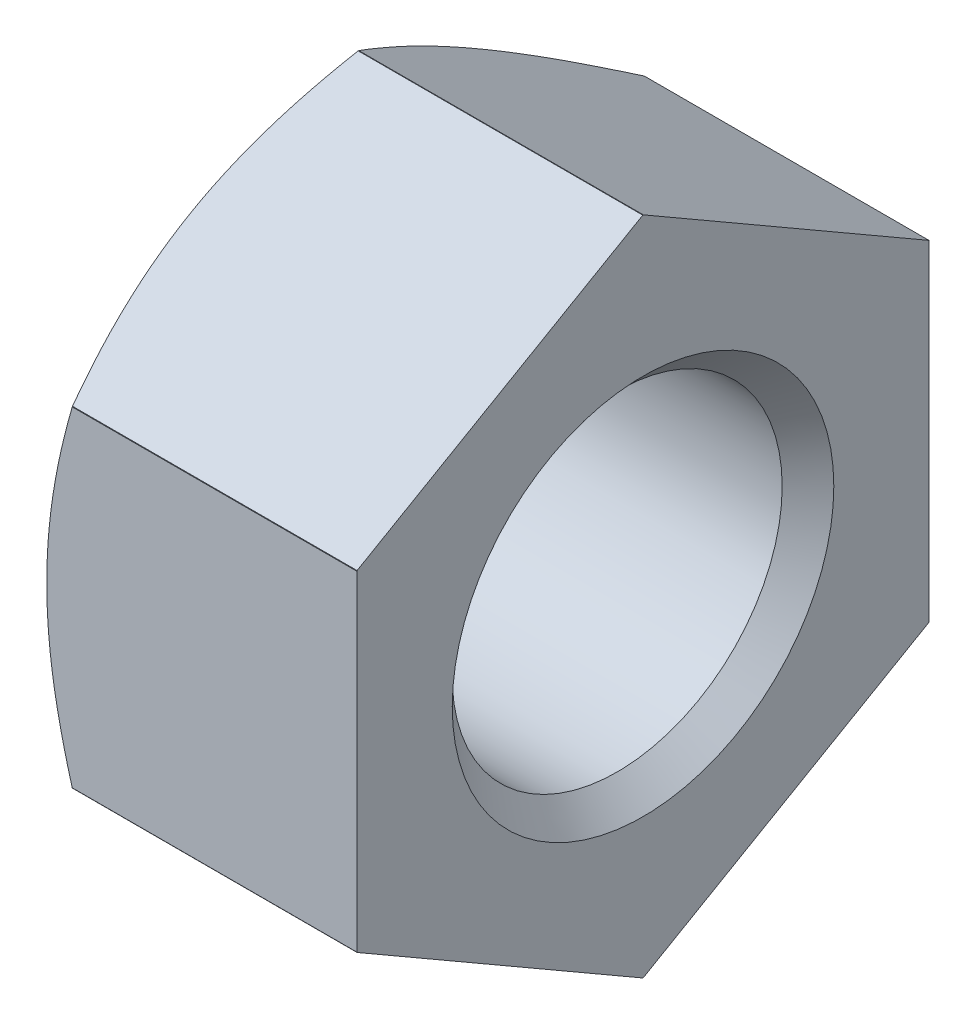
ISO-10303-21;
HEADER;
FILE_DESCRIPTION(('STEP AP214'),'2;1');
FILE_NAME('part.step','',(''),(''),'','','');
FILE_SCHEMA(('AUTOMOTIVE_DESIGN { 1 0 10303 214 1 1 1 1 }'));
ENDSEC;
DATA;
#1=APPLICATION_CONTEXT('core data for automotive mechanical design processes');
#2=APPLICATION_PROTOCOL_DEFINITION('international standard','automotive_design',2000,#1);
#3=PRODUCT_CONTEXT('',#1,'mechanical');
#4=PRODUCT('Part','Part','',(#3));
#5=PRODUCT_RELATED_PRODUCT_CATEGORY('part','',(#4));
#6=PRODUCT_DEFINITION_FORMATION('','',#4);
#7=PRODUCT_DEFINITION_CONTEXT('part definition',#1,'design');
#8=PRODUCT_DEFINITION('design','',#6,#7);
#9=PRODUCT_DEFINITION_SHAPE('','',#8);
#10=(LENGTH_UNIT() NAMED_UNIT(*) SI_UNIT(.MILLI.,.METRE.));
#11=(NAMED_UNIT(*) PLANE_ANGLE_UNIT() SI_UNIT($,.RADIAN.));
#12=(NAMED_UNIT(*) SI_UNIT($,.STERADIAN.) SOLID_ANGLE_UNIT());
#13=UNCERTAINTY_MEASURE_WITH_UNIT(LENGTH_MEASURE(1.E-05),#10,'distance_accuracy_value','');
#14=(GEOMETRIC_REPRESENTATION_CONTEXT(3) GLOBAL_UNCERTAINTY_ASSIGNED_CONTEXT((#13)) GLOBAL_UNIT_ASSIGNED_CONTEXT((#10,
#11,#12)) REPRESENTATION_CONTEXT('',''));
#15=CARTESIAN_POINT('',(0.,0.,0.));
#16=DIRECTION('',(0.,0.,1.));
#17=DIRECTION('',(1.,0.,0.));
#18=AXIS2_PLACEMENT_3D('',#15,#16,#17);
#19=CARTESIAN_POINT('',(-6.5,0.,0.));
#20=DIRECTION('',(1.,0.,0.));
#21=DIRECTION('',(0.,0.,-1.));
#22=AXIS2_PLACEMENT_3D('',#19,#20,#21);
#23=CONICAL_SURFACE('',#22,12.,1.0471975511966);
#24=CARTESIAN_POINT('',(-5.4319020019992,0.,0.));
#25=DIRECTION('',(1.,0.,0.));
#26=DIRECTION('',(0.,-0.499305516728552,0.866425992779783));
#27=AXIS2_PLACEMENT_3D('',#24,#25,#26);
#28=CIRCLE('',#27,13.85);
#29=CARTESIAN_POINT('',(-5.4319020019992,-6.91538140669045,12.));
#30=VERTEX_POINT('',#29);
#31=CARTESIAN_POINT('',(-5.4319020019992,-6.93461414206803,11.9888959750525));
#32=VERTEX_POINT('',#31);
#33=EDGE_CURVE('E142',#30,#32,#28,.T.);
#34=ORIENTED_EDGE('',*,*,#33,.F.);
#35=CARTESIAN_POINT('',(-5.43190203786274,-6.91538128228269,12.));
#36=CARTESIAN_POINT('',(-5.461403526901,-6.81304286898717,11.9999985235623));
#37=CARTESIAN_POINT('',(-5.49052497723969,-6.7105942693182,11.9998405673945));
#38=CARTESIAN_POINT('',(-5.54713775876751,-6.5082183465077,11.99934603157));
#39=CARTESIAN_POINT('',(-5.57465186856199,-6.40829738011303,11.9990143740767));
#40=CARTESIAN_POINT('',(-5.62812601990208,-6.21062034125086,11.9983017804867));
#41=CARTESIAN_POINT('',(-5.65410752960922,-6.11287007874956,11.9979222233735));
#42=CARTESIAN_POINT('',(-5.70459295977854,-5.91918401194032,11.9972095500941));
#43=CARTESIAN_POINT('',(-5.72911647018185,-5.82325332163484,11.9968756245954));
#44=CARTESIAN_POINT('',(-5.77676297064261,-5.6328616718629,11.9963207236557));
#45=CARTESIAN_POINT('',(-5.79990314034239,-5.53840502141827,11.9960978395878));
#46=CARTESIAN_POINT('',(-5.84486054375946,-5.35062286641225,11.9958028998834));
#47=CARTESIAN_POINT('',(-5.86669208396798,-5.25730079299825,11.9957287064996));
#48=CARTESIAN_POINT('',(-5.9091101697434,-5.07145555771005,11.9957419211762));
#49=CARTESIAN_POINT('',(-5.92970778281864,-4.97893492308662,11.9958275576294));
#50=CARTESIAN_POINT('',(-5.9697365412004,-4.79436702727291,11.9961444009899));
#51=CARTESIAN_POINT('',(-5.98917526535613,-4.70232140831,11.9963745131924));
#52=CARTESIAN_POINT('',(-6.02696398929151,-4.51838483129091,11.9969405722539));
#53=CARTESIAN_POINT('',(-6.04531797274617,-4.42649469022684,11.9972760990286));
#54=CARTESIAN_POINT('',(-6.08101863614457,-4.24255836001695,11.9979816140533));
#55=CARTESIAN_POINT('',(-6.09836572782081,-4.15051225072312,11.9983515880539));
#56=CARTESIAN_POINT('',(-6.13212044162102,-3.96595901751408,11.9990550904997));
#57=CARTESIAN_POINT('',(-6.14852505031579,-3.87345134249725,11.9993885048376));
#58=CARTESIAN_POINT('',(-6.180512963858,-3.6876869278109,11.9998300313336));
#59=CARTESIAN_POINT('',(-6.19609037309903,-3.5944291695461,11.9999366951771));
#60=CARTESIAN_POINT('',(-6.226394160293,-3.40659005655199,12.0000640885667));
#61=CARTESIAN_POINT('',(-6.24110761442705,-3.31200660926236,12.0000837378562));
#62=CARTESIAN_POINT('',(-6.26953367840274,-3.12144724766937,12.0001997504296));
#63=CARTESIAN_POINT('',(-6.2832310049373,-3.02546905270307,12.0002970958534));
#64=CARTESIAN_POINT('',(-6.30956755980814,-2.8325842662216,12.0004266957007));
#65=CARTESIAN_POINT('',(-6.32219743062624,-2.73567639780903,12.0004584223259));
#66=CARTESIAN_POINT('',(-6.34629026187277,-2.54137289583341,12.0004554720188));
#67=CARTESIAN_POINT('',(-6.35774900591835,-2.44397673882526,12.0004205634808));
#68=CARTESIAN_POINT('',(-6.37940617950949,-2.24912366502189,12.0002998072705));
#69=CARTESIAN_POINT('',(-6.38960561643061,-2.15166686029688,12.0002140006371));
#70=CARTESIAN_POINT('',(-6.4086423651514,-1.95710180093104,12.0000668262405));
#71=CARTESIAN_POINT('',(-6.41748610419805,-1.85999417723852,12.0000053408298));
#72=CARTESIAN_POINT('',(-6.43379992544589,-1.66565397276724,11.9999946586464));
#73=CARTESIAN_POINT('',(-6.44126987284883,-1.56842138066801,12.0000454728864));
#74=CARTESIAN_POINT('',(-6.45491566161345,-1.37329214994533,12.0001550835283));
#75=CARTESIAN_POINT('',(-6.46108365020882,-1.27539496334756,12.000213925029));
#76=CARTESIAN_POINT('',(-6.47209497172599,-1.07922640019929,12.0002981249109));
#77=CARTESIAN_POINT('',(-6.47693420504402,-0.980954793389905,12.0003233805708));
#78=CARTESIAN_POINT('',(-6.48526180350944,-0.784322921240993,12.0003234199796));
#79=CARTESIAN_POINT('',(-6.48874973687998,-0.68596263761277,12.000298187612));
#80=CARTESIAN_POINT('',(-6.49434850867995,-0.489433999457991,12.0002119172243));
#81=CARTESIAN_POINT('',(-6.49646256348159,-0.391265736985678,12.0001509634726));
#82=CARTESIAN_POINT('',(-6.49928342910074,-0.195397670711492,12.0000480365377));
#83=CARTESIAN_POINT('',(-6.49999719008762,-0.0976979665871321,12.0000059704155));
#84=CARTESIAN_POINT('',(-6.49999999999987,2.33979187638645E-06,12.));
#85=B_SPLINE_CURVE_WITH_KNOTS('',3,(#35,#36,#37,#38,#39,#40,#41,#42,#43,#44,#45,#46,#47,#48,#49,
#50,#51,#52,#53,#54,#55,#56,#57,#58,#59,#60,#61,#62,#63,#64,#65,#66,#67,#68,#69,#70,#71,#72,#73,
#74,#75,#76,#77,#78,#79,#80,#81,#82,#83,#84),.UNSPECIFIED.,.F.,.F.,(4,2,2,2,2,2,2,2,2,2,2,2,2,2,
2,2,2,2,2,2,2,2,2,2,4),(0.,0.3195175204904,0.630435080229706,0.933865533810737,1.23090944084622,
1.52265445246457,1.81017401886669,2.09452553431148,2.37674807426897,2.65785990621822,
2.93885596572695,3.22070548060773,3.50434989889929,3.79150597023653,4.08235052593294,
4.375525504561,4.66972133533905,4.96368027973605,5.25619935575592,5.54874711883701,
5.84301191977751,6.13817466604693,6.43343164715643,6.72799489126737,7.0210923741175),.UNSPECIFIED.);
#86=CARTESIAN_POINT('',(-6.5,0.,12.));
#87=VERTEX_POINT('',#86);
#88=EDGE_CURVE('E126',#30,#87,#85,.T.);
#89=ORIENTED_EDGE('',*,*,#88,.T.);
#90=CARTESIAN_POINT('',(-6.5,0.,0.));
#91=DIRECTION('',(1.,0.,0.));
#92=DIRECTION('',(0.,0.,1.));
#93=AXIS2_PLACEMENT_3D('',#90,#91,#92);
#94=CIRCLE('',#93,12.);
#95=CARTESIAN_POINT('',(-6.5,-10.3923048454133,6.));
#96=VERTEX_POINT('',#95);
#97=EDGE_CURVE('E141',#87,#96,#94,.T.);
#98=ORIENTED_EDGE('',*,*,#97,.T.);
#99=CARTESIAN_POINT('',(-6.5,-10.3923050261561,5.99999968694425));
#100=CARTESIAN_POINT('',(-6.49999410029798,-10.3555261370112,6.06372374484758));
#101=CARTESIAN_POINT('',(-6.49960293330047,-10.3187384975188,6.12744280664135));
#102=CARTESIAN_POINT('',(-6.4980440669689,-10.2452130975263,6.25478381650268));
#103=CARTESIAN_POINT('',(-6.49687743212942,-10.2084753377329,6.31840577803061));
#104=CARTESIAN_POINT('',(-6.49376916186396,-10.1351932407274,6.44533344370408));
#105=CARTESIAN_POINT('',(-6.49183128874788,-10.0986488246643,6.50863919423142));
#106=CARTESIAN_POINT('',(-6.48716988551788,-10.0255089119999,6.6353863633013));
#107=CARTESIAN_POINT('',(-6.4844445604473,-9.98891349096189,6.69882775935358));
#108=CARTESIAN_POINT('',(-6.47822472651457,-9.91566784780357,6.82579569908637));
#109=CARTESIAN_POINT('',(-6.47472882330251,-9.87901764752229,6.88932218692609));
#110=CARTESIAN_POINT('',(-6.46697782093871,-9.80569705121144,7.01638240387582));
#111=CARTESIAN_POINT('',(-6.46272214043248,-9.76902666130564,7.07991610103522));
#112=CARTESIAN_POINT('',(-6.45346342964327,-9.69570499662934,7.20691339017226));
#113=CARTESIAN_POINT('',(-6.44846063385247,-9.65905371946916,7.27037699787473));
#114=CARTESIAN_POINT('',(-6.43771907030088,-9.58581793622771,7.39715932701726));
#115=CARTESIAN_POINT('',(-6.43198136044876,-9.54923340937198,7.46047812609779));
#116=CARTESIAN_POINT('',(-6.41978133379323,-9.47618657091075,7.58689824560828));
#117=CARTESIAN_POINT('',(-6.41332091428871,-9.43972418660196,7.64999970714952));
#118=CARTESIAN_POINT('',(-6.39968429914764,-9.36696820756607,7.77594198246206));
#119=CARTESIAN_POINT('',(-6.39251054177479,-9.33067445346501,7.8387829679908));
#120=CARTESIAN_POINT('',(-6.3773998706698,-9.25807519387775,7.96458690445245));
#121=CARTESIAN_POINT('',(-6.36946101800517,-9.22176990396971,8.02754974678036));
#122=CARTESIAN_POINT('',(-6.35284513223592,-9.14908996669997,8.1536085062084));
#123=CARTESIAN_POINT('',(-6.3441658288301,-9.11271546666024,8.21670420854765));
#124=CARTESIAN_POINT('',(-6.32610645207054,-9.03995789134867,8.34287485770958));
#125=CARTESIAN_POINT('',(-6.31672569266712,-9.00357484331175,8.40594972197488));
#126=CARTESIAN_POINT('',(-6.2973022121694,-8.93087292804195,8.53192570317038));
#127=CARTESIAN_POINT('',(-6.28726034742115,-8.8945540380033,8.59482693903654));
#128=CARTESIAN_POINT('',(-6.26655219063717,-8.8220696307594,8.72030588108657));
#129=CARTESIAN_POINT('',(-6.25588828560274,-8.7859040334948,8.78288393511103));
#130=CARTESIAN_POINT('',(-6.23397743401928,-8.71382327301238,8.90756611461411));
#131=CARTESIAN_POINT('',(-6.22273440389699,-8.67790791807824,8.96967081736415));
#132=CARTESIAN_POINT('',(-6.1996926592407,-8.60646276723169,9.09326953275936));
#133=CARTESIAN_POINT('',(-6.18789954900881,-8.57093230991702,9.15476420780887));
#134=CARTESIAN_POINT('',(-6.16380800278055,-8.50023576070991,9.27711286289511));
#135=CARTESIAN_POINT('',(-6.15151500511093,-8.46506924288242,9.33796766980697));
#136=CARTESIAN_POINT('',(-6.12647478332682,-8.39483945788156,9.45921767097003));
#137=CARTESIAN_POINT('',(-6.11373018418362,-8.35977657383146,9.51961362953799));
#138=CARTESIAN_POINT('',(-6.08773005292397,-8.28977709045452,9.64010216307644));
#139=CARTESIAN_POINT('',(-6.07447628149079,-8.25484044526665,9.70019509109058));
#140=CARTESIAN_POINT('',(-6.04743433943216,-8.18505420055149,9.82020364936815));
#141=CARTESIAN_POINT('',(-6.0336468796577,-8.15020454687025,9.88011940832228));
#142=CARTESIAN_POINT('',(-6.00550549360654,-8.08055935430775,9.99990471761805));
#143=CARTESIAN_POINT('',(-5.99115119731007,-8.04576386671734,10.0597742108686));
#144=CARTESIAN_POINT('',(-5.96184642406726,-7.97618185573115,10.1795943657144));
#145=CARTESIAN_POINT('',(-5.94689446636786,-7.94139560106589,10.23954482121));
#146=CARTESIAN_POINT('',(-5.91636405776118,-7.87177975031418,10.35965274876));
#147=CARTESIAN_POINT('',(-5.90078300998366,-7.8369507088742,10.419809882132));
#148=CARTESIAN_POINT('',(-5.86896426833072,-7.76718855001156,10.5404547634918));
#149=CARTESIAN_POINT('',(-5.85272288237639,-7.73225629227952,10.6009420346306));
#150=CARTESIAN_POINT('',(-5.81955323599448,-7.66221891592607,10.7223685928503));
#151=CARTESIAN_POINT('',(-5.80262023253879,-7.62711493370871,10.7833072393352));
#152=CARTESIAN_POINT('',(-5.76803707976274,-7.55665716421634,10.9057555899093));
#153=CARTESIAN_POINT('',(-5.75038120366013,-7.52130471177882,10.9672644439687));
#154=CARTESIAN_POINT('',(-5.7143219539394,-7.45026486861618,11.090969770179));
#155=CARTESIAN_POINT('',(-5.69591195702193,-7.41457888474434,11.1531651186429));
#156=CARTESIAN_POINT('',(-5.65831401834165,-7.34277857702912,11.2783573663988));
#157=CARTESIAN_POINT('',(-5.63911866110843,-7.30666556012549,11.3413527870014));
#158=CARTESIAN_POINT('',(-5.59991944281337,-7.2339093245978,11.4682562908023));
#159=CARTESIAN_POINT('',(-5.5799074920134,-7.19726709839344,11.5321624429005));
#160=CARTESIAN_POINT('',(-5.53904440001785,-7.1233422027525,11.66099558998));
#161=CARTESIAN_POINT('',(-5.51818462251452,-7.08605996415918,11.7259200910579));
#162=CARTESIAN_POINT('',(-5.47559506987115,-7.01073526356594,11.8568946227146));
#163=CARTESIAN_POINT('',(-5.45385624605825,-6.97269237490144,11.9229414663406));
#164=CARTESIAN_POINT('',(-5.43190200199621,-6.93461414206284,11.9888959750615));
#165=B_SPLINE_CURVE_WITH_KNOTS('',3,(#99,#100,#101,#102,#103,#104,#105,#106,#107,#108,#109,#110,
#111,#112,#113,#114,#115,#116,#117,#118,#119,#120,#121,#122,#123,#124,#125,#126,#127,#128,#129,
#130,#131,#132,#133,#134,#135,#136,#137,#138,#139,#140,#141,#142,#143,#144,#145,#146,#147,#148,
#149,#150,#151,#152,#153,#154,#155,#156,#157,#158,#159,#160,#161,#162,#163,#164),.UNSPECIFIED.,
.F.,.F.,(4,2,2,2,2,2,2,2,2,2,2,2,2,2,2,2,2,2,2,2,2,2,2,2,2,2,2,2,2,2,2,2,4),(0.,
0.220727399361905,0.44115242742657,0.660515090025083,0.880381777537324,1.10064962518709,
1.32108674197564,1.54145481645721,1.7615091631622,1.98099879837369,2.19976242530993,
2.41909580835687,2.63912768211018,2.85937764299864,3.07934771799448,3.29852308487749,
3.51637284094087,3.73235086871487,3.94640464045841,4.1593709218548,4.37165743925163,
4.58367032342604,4.79582397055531,5.008540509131,5.22224922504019,5.43738596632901,
5.65439255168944,5.8737162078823,6.09580906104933,6.32112770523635,6.55013286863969,
6.78328919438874,7.02106514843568),.UNSPECIFIED.);
#166=EDGE_CURVE('E155',#96,#32,#165,.T.);
#167=ORIENTED_EDGE('',*,*,#166,.T.);
#168=EDGE_LOOP('',(#34,#89,#98,#167));
#169=FACE_BOUND('',#168,.T.);
#170=ADVANCED_FACE('F17',(#169),#23,.T.);
#171=CARTESIAN_POINT('',(6.5,0.,0.));
#172=DIRECTION('',(1.,0.,0.));
#173=DIRECTION('',(0.,0.,-1.));
#174=AXIS2_PLACEMENT_3D('',#171,#172,#173);
#175=CYLINDRICAL_SURFACE('',#174,13.85);
#176=CARTESIAN_POINT('',(6.5,0.,0.));
#177=DIRECTION('',(1.,0.,0.));
#178=DIRECTION('',(0.,-0.499305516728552,0.866425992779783));
#179=AXIS2_PLACEMENT_3D('',#176,#177,#178);
#180=CIRCLE('',#179,13.85);
#181=CARTESIAN_POINT('',(6.5,-6.91538140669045,12.));
#182=VERTEX_POINT('',#181);
#183=CARTESIAN_POINT('',(6.5,-6.93461414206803,11.9888959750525));
#184=VERTEX_POINT('',#183);
#185=EDGE_CURVE('E150',#182,#184,#180,.T.);
#186=ORIENTED_EDGE('',*,*,#185,.F.);
#187=DIRECTION('',(-1.,0.,0.));
#188=VECTOR('',#187,1.);
#189=CARTESIAN_POINT('',(6.5,-6.91538140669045,12.));
#190=LINE('',#189,#188);
#191=EDGE_CURVE('E131',#182,#30,#190,.T.);
#192=ORIENTED_EDGE('',*,*,#191,.T.);
#193=ORIENTED_EDGE('',*,*,#33,.T.);
#194=DIRECTION('',(1.,0.,0.));
#195=VECTOR('',#194,1.);
#196=CARTESIAN_POINT('',(-5.4319020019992,-6.93461414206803,11.9888959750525));
#197=LINE('',#196,#195);
#198=EDGE_CURVE('E151',#32,#184,#197,.T.);
#199=ORIENTED_EDGE('',*,*,#198,.T.);
#200=EDGE_LOOP('',(#186,#192,#193,#199));
#201=FACE_BOUND('',#200,.T.);
#202=ADVANCED_FACE('F148',(#201),#175,.T.);
#203=CARTESIAN_POINT('',(6.5,6.9282032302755,12.));
#204=DIRECTION('',(0.,0.,-1.));
#205=DIRECTION('',(-1.,0.,0.));
#206=AXIS2_PLACEMENT_3D('',#203,#204,#205);
#207=PLANE('',#206);
#208=CARTESIAN_POINT('',(-6.49999999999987,2.33979187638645E-06,12.));
#209=CARTESIAN_POINT('',(-6.49999956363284,0.032924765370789,12.0000007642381));
#210=CARTESIAN_POINT('',(-6.49992175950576,0.0658472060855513,12.0000000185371));
#211=CARTESIAN_POINT('',(-6.49960975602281,0.131465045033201,12.0000003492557));
#212=CARTESIAN_POINT('',(-6.49937663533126,0.164160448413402,12.000001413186));
#213=CARTESIAN_POINT('',(-6.49875225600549,0.229564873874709,12.0000100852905));
#214=CARTESIAN_POINT('',(-6.49836092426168,0.262273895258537,12.000017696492));
#215=CARTESIAN_POINT('',(-6.49742199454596,0.32771686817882,12.0000357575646));
#216=CARTESIAN_POINT('',(-6.49687426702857,0.360450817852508,12.0000462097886));
#217=CARTESIAN_POINT('',(-6.49562317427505,0.42593736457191,12.0000686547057));
#218=CARTESIAN_POINT('',(-6.49491970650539,0.458689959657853,12.0000806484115));
#219=CARTESIAN_POINT('',(-6.49335809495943,0.524207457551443,12.0001045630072));
#220=CARTESIAN_POINT('',(-6.49249987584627,0.55697235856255,12.0001164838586));
#221=CARTESIAN_POINT('',(-6.49062963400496,0.622508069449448,12.0001390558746));
#222=CARTESIAN_POINT('',(-6.48961756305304,0.655278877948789,12.0001497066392));
#223=CARTESIAN_POINT('',(-6.48744051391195,0.720819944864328,12.0001687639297));
#224=CARTESIAN_POINT('',(-6.48627551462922,0.753590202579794,12.0001771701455));
#225=CARTESIAN_POINT('',(-6.48379349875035,0.819123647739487,12.0001910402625));
#226=CARTESIAN_POINT('',(-6.48247648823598,0.851886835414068,12.0001965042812));
#227=CARTESIAN_POINT('',(-6.47969134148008,0.917399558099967,12.0002040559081));
#228=CARTESIAN_POINT('',(-6.47822323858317,0.950149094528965,12.0002061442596));
#229=CARTESIAN_POINT('',(-6.47513679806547,1.0156278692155,12.0002067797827));
#230=CARTESIAN_POINT('',(-6.47351852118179,1.04835711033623,12.00020532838));
#231=CARTESIAN_POINT('',(-6.47013262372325,1.11378858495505,12.0001989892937));
#232=CARTESIAN_POINT('',(-6.46836509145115,1.14649082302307,12.0001941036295));
#233=CARTESIAN_POINT('',(-6.46468157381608,1.21186151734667,12.0001812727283));
#234=CARTESIAN_POINT('',(-6.46276570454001,1.24452998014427,12.0001733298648));
#235=CARTESIAN_POINT('',(-6.45878640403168,1.30982628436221,12.0001550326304));
#236=CARTESIAN_POINT('',(-6.45672311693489,1.3424541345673,12.0001446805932));
#237=CARTESIAN_POINT('',(-6.45244986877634,1.40766230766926,12.0001224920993));
#238=CARTESIAN_POINT('',(-6.45024008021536,1.44024264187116,12.0001106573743));
#239=CARTESIAN_POINT('',(-6.4456747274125,1.50534881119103,12.0000866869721));
#240=CARTESIAN_POINT('',(-6.44331936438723,1.5378746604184,12.0000745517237));
#241=CARTESIAN_POINT('',(-6.43846372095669,1.60286481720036,12.0000515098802));
#242=CARTESIAN_POINT('',(-6.43596367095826,1.63532914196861,12.0000406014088));
#243=CARTESIAN_POINT('',(-6.43081965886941,1.70018915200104,12.0000215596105));
#244=CARTESIAN_POINT('',(-6.42817595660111,1.73258485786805,12.0000134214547));
#245=CARTESIAN_POINT('',(-6.42274507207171,1.79730070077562,12.0000027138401));
#246=CARTESIAN_POINT('',(-6.41995817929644,1.82962086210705,12.0000001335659));
#247=CARTESIAN_POINT('',(-6.41423897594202,1.89422901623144,11.9999999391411));
#248=CARTESIAN_POINT('',(-6.41130675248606,1.92651701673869,12.0000023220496));
#249=CARTESIAN_POINT('',(-6.4052964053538,1.99109434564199,12.0000091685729));
#250=CARTESIAN_POINT('',(-6.40221821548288,2.02338366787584,12.0000136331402));
#251=CARTESIAN_POINT('',(-6.39591704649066,2.087961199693,12.0000240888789));
#252=CARTESIAN_POINT('',(-6.39269401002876,2.1202494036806,12.0000300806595));
#253=CARTESIAN_POINT('',(-6.38610459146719,2.18482219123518,12.0000425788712));
#254=CARTESIAN_POINT('',(-6.38273816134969,2.21710676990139,12.0000490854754));
#255=CARTESIAN_POINT('',(-6.37586330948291,2.28166969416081,12.0000618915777));
#256=CARTESIAN_POINT('',(-6.3723548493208,2.31394803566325,12.0000681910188));
#257=CARTESIAN_POINT('',(-6.36519731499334,2.37849577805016,12.0000799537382));
#258=CARTESIAN_POINT('',(-6.36154821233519,2.41076517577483,12.0000854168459));
#259=CARTESIAN_POINT('',(-6.35411076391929,2.47529222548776,12.0000950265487));
#260=CARTESIAN_POINT('',(-6.35032239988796,2.50754987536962,12.0000991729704));
#261=CARTESIAN_POINT('',(-6.34260780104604,2.57205052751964,12.0001058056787));
#262=CARTESIAN_POINT('',(-6.3386815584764,2.60429352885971,12.0001082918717));
#263=CARTESIAN_POINT('',(-6.33069257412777,2.6687618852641,12.0001114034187));
#264=CARTESIAN_POINT('',(-6.32662983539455,2.70098724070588,12.0001120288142));
#265=CARTESIAN_POINT('',(-6.3183692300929,2.76541721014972,12.0001113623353));
#266=CARTESIAN_POINT('',(-6.31417137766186,2.79762182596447,12.000110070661));
#267=CARTESIAN_POINT('',(-6.30564191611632,2.86200712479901,12.0001056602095));
#268=CARTESIAN_POINT('',(-6.30131033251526,2.89418781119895,12.000102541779));
#269=CARTESIAN_POINT('',(-6.29251477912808,2.95852196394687,12.0000947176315));
#270=CARTESIAN_POINT('',(-6.2880508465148,2.99067543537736,12.0000900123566));
#271=CARTESIAN_POINT('',(-6.27899196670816,3.05495177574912,12.0000794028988));
#272=CARTESIAN_POINT('',(-6.27439706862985,3.08707465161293,12.0000734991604));
#273=CARTESIAN_POINT('',(-6.265077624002,3.15128632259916,12.0000610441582));
#274=CARTESIAN_POINT('',(-6.26035313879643,3.18337512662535,12.0000544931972));
#275=CARTESIAN_POINT('',(-6.25077590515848,3.24751508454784,12.0000414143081));
#276=CARTESIAN_POINT('',(-6.24592323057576,3.27956624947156,12.000034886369));
#277=CARTESIAN_POINT('',(-6.23609093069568,3.34362725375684,12.0000228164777));
#278=CARTESIAN_POINT('',(-6.23111139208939,3.37563710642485,12.0000172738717));
#279=CARTESIAN_POINT('',(-6.22102694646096,3.43961176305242,12.0000077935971));
#280=CARTESIAN_POINT('',(-6.21592213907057,3.47157658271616,12.0000038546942));
#281=CARTESIAN_POINT('',(-6.20558773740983,3.53545714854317,12.0000002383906));
#282=CARTESIAN_POINT('',(-6.20035825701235,3.5673729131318,12.0000005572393));
#283=CARTESIAN_POINT('',(-6.18978025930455,3.63115506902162,11.999997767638));
#284=CARTESIAN_POINT('',(-6.18443185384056,3.66302147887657,11.999994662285));
#285=CARTESIAN_POINT('',(-6.17361583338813,3.72671029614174,11.9999862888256));
#286=CARTESIAN_POINT('',(-6.16814830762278,3.75853271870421,11.9999810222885));
#287=CARTESIAN_POINT('',(-6.15709380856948,3.82213965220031,11.9999693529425));
#288=CARTESIAN_POINT('',(-6.15150689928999,3.85392417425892,11.9999629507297));
#289=CARTESIAN_POINT('',(-6.14021338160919,3.91746138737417,11.9999499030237));
#290=CARTESIAN_POINT('',(-6.13450681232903,3.94921408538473,11.9999432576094));
#291=CARTESIAN_POINT('',(-6.12297372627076,4.01269372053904,11.99993045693));
#292=CARTESIAN_POINT('',(-6.11714722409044,4.04442066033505,11.9999243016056));
#293=CARTESIAN_POINT('',(-6.10537402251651,4.10785483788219,11.9999130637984));
#294=CARTESIAN_POINT('',(-6.09942731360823,4.13956207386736,11.9999079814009));
#295=CARTESIAN_POINT('',(-6.08741344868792,4.20296289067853,11.9998993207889));
#296=CARTESIAN_POINT('',(-6.08134625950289,4.23465646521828,11.9998957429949));
#297=CARTESIAN_POINT('',(-6.0690911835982,4.29803599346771,11.9998903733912));
#298=CARTESIAN_POINT('',(-6.062903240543,4.32972193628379,11.9998885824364));
#299=CARTESIAN_POINT('',(-6.05040640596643,4.39309222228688,11.9998869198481));
#300=CARTESIAN_POINT('',(-6.04409743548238,4.42477654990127,11.9998870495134));
#301=CARTESIAN_POINT('',(-6.03135829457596,4.48814961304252,11.9998892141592));
#302=CARTESIAN_POINT('',(-6.02492802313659,4.51983832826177,11.9998912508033));
#303=CARTESIAN_POINT('',(-6.01194602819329,4.58322615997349,11.9998970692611));
#304=CARTESIAN_POINT('',(-6.005394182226,4.61492525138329,11.9999008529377));
#305=CARTESIAN_POINT('',(-5.99216878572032,4.67833981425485,11.9999098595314));
#306=CARTESIAN_POINT('',(-5.98549509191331,4.71005525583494,11.9999150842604));
#307=CARTESIAN_POINT('',(-5.97202574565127,4.77350848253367,11.9999265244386));
#308=CARTESIAN_POINT('',(-5.9652299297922,4.8052462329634,11.9999327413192));
#309=CARTESIAN_POINT('',(-5.95151608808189,4.86875002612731,11.9999455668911));
#310=CARTESIAN_POINT('',(-5.94459787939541,4.9005160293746,11.9999521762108));
#311=CARTESIAN_POINT('',(-5.93063898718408,4.96408225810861,11.9999650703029));
#312=CARTESIAN_POINT('',(-5.92359810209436,4.9958824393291,11.9999713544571));
#313=CARTESIAN_POINT('',(-5.9093936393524,5.05952294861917,11.9999826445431));
#314=CARTESIAN_POINT('',(-5.90222984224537,5.09136322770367,11.9999876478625));
#315=CARTESIAN_POINT('',(-5.8877791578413,5.15508979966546,11.9999956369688));
#316=CARTESIAN_POINT('',(-5.88049203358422,5.18697603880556,11.9999986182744));
#317=CARTESIAN_POINT('',(-5.86580967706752,5.25073665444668,12.0000003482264));
#318=CARTESIAN_POINT('',(-5.85841440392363,5.28261102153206,11.9999990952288));
#319=CARTESIAN_POINT('',(-5.84355649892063,5.34618136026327,11.999990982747));
#320=CARTESIAN_POINT('',(-5.83609436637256,5.37787744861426,11.9999841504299));
#321=CARTESIAN_POINT('',(-5.8210962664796,5.44111841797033,11.9999703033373));
#322=CARTESIAN_POINT('',(-5.81356071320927,5.47266339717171,11.9999632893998));
#323=CARTESIAN_POINT('',(-5.79840723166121,5.535642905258,11.999951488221));
#324=CARTESIAN_POINT('',(-5.79078958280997,5.56707750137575,11.9999466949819));
#325=CARTESIAN_POINT('',(-5.77546313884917,5.62987730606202,11.9999409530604));
#326=CARTESIAN_POINT('',(-5.76775448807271,5.66124254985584,11.9999399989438));
#327=CARTESIAN_POINT('',(-5.75223732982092,5.72394507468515,11.9999421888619));
#328=CARTESIAN_POINT('',(-5.74442883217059,5.75528235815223,11.9999453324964));
#329=CARTESIAN_POINT('',(-5.72870325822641,5.81797072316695,11.9999547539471));
#330=CARTESIAN_POINT('',(-5.72078605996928,5.84932177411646,11.9999610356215));
#331=CARTESIAN_POINT('',(-5.70483433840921,5.91207975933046,11.9999745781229));
#332=CARTESIAN_POINT('',(-5.69679956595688,5.94348663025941,11.9999818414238));
#333=CARTESIAN_POINT('',(-5.68060403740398,6.00639868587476,11.9999937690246));
#334=CARTESIAN_POINT('',(-5.67244291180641,6.03790377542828,11.9999984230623));
#335=CARTESIAN_POINT('',(-5.65601934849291,6.10092564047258,12.0000010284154));
#336=CARTESIAN_POINT('',(-5.64775680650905,6.13244238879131,11.9999989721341));
#337=CARTESIAN_POINT('',(-5.63117030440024,6.19532570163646,11.9999952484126));
#338=CARTESIAN_POINT('',(-5.62284671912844,6.22669236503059,11.9999935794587));
#339=CARTESIAN_POINT('',(-5.60611842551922,6.28935538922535,11.9999921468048));
#340=CARTESIAN_POINT('',(-5.59771385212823,6.32065178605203,11.9999923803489));
#341=CARTESIAN_POINT('',(-5.58080217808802,6.38325920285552,11.9999949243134));
#342=CARTESIAN_POINT('',(-5.57229496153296,6.41457019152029,11.999997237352));
#343=CARTESIAN_POINT('',(-5.55516633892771,6.47726040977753,11.9999996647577));
#344=CARTESIAN_POINT('',(-5.54654466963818,6.50863956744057,11.9999997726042));
#345=CARTESIAN_POINT('',(-5.52922957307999,6.57131049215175,11.9999995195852));
#346=CARTESIAN_POINT('',(-5.52053632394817,6.60260230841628,11.9999991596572));
#347=CARTESIAN_POINT('',(-5.50305254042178,6.66519380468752,11.9999992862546));
#348=CARTESIAN_POINT('',(-5.49426191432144,6.69649345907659,11.9999997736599));
#349=CARTESIAN_POINT('',(-5.47659506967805,6.75906484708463,12.0000001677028));
#350=CARTESIAN_POINT('',(-5.46771886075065,6.79033658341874,12.0000000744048));
#351=CARTESIAN_POINT('',(-5.44987624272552,6.8528714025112,11.9999998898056));
#352=CARTESIAN_POINT('',(-5.44090979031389,6.8841344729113,11.9999997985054));
#353=CARTESIAN_POINT('',(-5.43190087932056,6.91538530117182,12.));
#354=B_SPLINE_CURVE_WITH_KNOTS('',3,(#208,#209,#210,#211,#212,#213,#214,#215,#216,#217,#218,
#219,#220,#221,#222,#223,#224,#225,#226,#227,#228,#229,#230,#231,#232,#233,#234,#235,#236,#237,
#238,#239,#240,#241,#242,#243,#244,#245,#246,#247,#248,#249,#250,#251,#252,#253,#254,#255,#256,
#257,#258,#259,#260,#261,#262,#263,#264,#265,#266,#267,#268,#269,#270,#271,#272,#273,#274,#275,
#276,#277,#278,#279,#280,#281,#282,#283,#284,#285,#286,#287,#288,#289,#290,#291,#292,#293,#294,
#295,#296,#297,#298,#299,#300,#301,#302,#303,#304,#305,#306,#307,#308,#309,#310,#311,#312,#313,
#314,#315,#316,#317,#318,#319,#320,#321,#322,#323,#324,#325,#326,#327,#328,#329,#330,#331,#332,
#333,#334,#335,#336,#337,#338,#339,#340,#341,#342,#343,#344,#345,#346,#347,#348,#349,#350,#351,
#352,#353),.UNSPECIFIED.,.F.,.F.,(4,2,2,2,2,2,2,2,2,2,2,2,2,2,2,2,2,2,2,2,2,2,2,2,2,2,2,2,2,2,2,
2,2,2,2,2,2,2,2,2,2,2,2,2,2,2,2,2,2,2,2,2,2,2,2,2,2,2,2,2,2,2,2,2,2,2,2,2,2,2,2,2,4),(0.,
0.0987672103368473,0.196855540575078,0.294989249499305,0.393204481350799,0.491484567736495,
0.589812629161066,0.688171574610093,0.786544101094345,0.884912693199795,0.983259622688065,
1.08156694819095,1.17981651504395,1.27798995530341,1.37606868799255,1.47403391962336,
1.57186664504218,1.66954764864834,1.76705750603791,1.86437744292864,1.96163972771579,
2.05894655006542,2.15629223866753,2.25367078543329,2.35107584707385,2.44850074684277,
2.54593847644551,2.64338169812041,2.74082274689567,2.8382536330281,2.93566604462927,
3.03305135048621,3.13040060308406,3.22770454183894,3.32495359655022,3.42213789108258,
3.51924724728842,3.61627106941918,3.71320720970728,3.81007308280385,3.90688826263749,
4.00367226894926,4.10044456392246,4.19722454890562,4.29403156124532,4.3908848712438,
4.48780367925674,4.58480711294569,4.68191422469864,4.77914398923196,4.8765153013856,
4.97404697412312,5.07175773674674,5.16966623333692,5.26779102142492,5.36595391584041,
5.46364166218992,5.56093913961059,5.65797227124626,5.75486800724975,5.85175428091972,
5.94875996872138,6.04601485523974,6.14364960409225,6.24139492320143,6.33875157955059,
6.4359672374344,6.53330546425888,6.63093146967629,6.72836209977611,6.82589397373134,
6.92341501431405,7.0209853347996),.UNSPECIFIED.);
#355=CARTESIAN_POINT('',(-5.4319020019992,6.91538140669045,12.));
#356=VERTEX_POINT('',#355);
#357=EDGE_CURVE('E134',#87,#356,#354,.T.);
#358=ORIENTED_EDGE('',*,*,#357,.F.);
#359=ORIENTED_EDGE('',*,*,#88,.F.);
#360=ORIENTED_EDGE('',*,*,#191,.F.);
#361=DIRECTION('',(0.,-1.,0.));
#362=VECTOR('',#361,1.);
#363=CARTESIAN_POINT('',(6.5,6.91538140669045,12.));
#364=LINE('',#363,#362);
#365=CARTESIAN_POINT('',(6.5,6.91538140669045,12.));
#366=VERTEX_POINT('',#365);
#367=EDGE_CURVE('E365',#366,#182,#364,.T.);
#368=ORIENTED_EDGE('',*,*,#367,.F.);
#369=DIRECTION('',(1.,0.,0.));
#370=VECTOR('',#369,1.);
#371=CARTESIAN_POINT('',(-5.4319020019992,6.91538140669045,12.));
#372=LINE('',#371,#370);
#373=EDGE_CURVE('E363',#356,#366,#372,.T.);
#374=ORIENTED_EDGE('',*,*,#373,.F.);
#375=EDGE_LOOP('',(#358,#359,#360,#368,#374));
#376=FACE_BOUND('',#375,.T.);
#377=ADVANCED_FACE('F129',(#376),#207,.F.);
#378=CARTESIAN_POINT('',(-6.5,0.,0.));
#379=DIRECTION('',(1.,0.,0.));
#380=DIRECTION('',(0.,0.,-1.));
#381=AXIS2_PLACEMENT_3D('',#378,#379,#380);
#382=PLANE('',#381);
#383=CARTESIAN_POINT('',(-6.5,0.,0.));
#384=DIRECTION('',(1.,0.,0.));
#385=DIRECTION('',(0.,0.,-1.));
#386=AXIS2_PLACEMENT_3D('',#383,#384,#385);
#387=CIRCLE('',#386,8.);
#388=CARTESIAN_POINT('',(-6.5,0.,-8.));
#389=VERTEX_POINT('',#388);
#390=EDGE_CURVE('E364',#389,#389,#387,.T.);
#391=ORIENTED_EDGE('',*,*,#390,.T.);
#392=EDGE_LOOP('',(#391));
#393=FACE_BOUND('',#392,.T.);
#394=CARTESIAN_POINT('',(-6.5,0.,0.));
#395=DIRECTION('',(1.,0.,0.));
#396=DIRECTION('',(0.,0.,-1.));
#397=AXIS2_PLACEMENT_3D('',#394,#395,#396);
#398=CIRCLE('',#397,12.);
#399=CARTESIAN_POINT('',(-6.5,0.,-12.));
#400=VERTEX_POINT('',#399);
#401=CARTESIAN_POINT('',(-6.5,10.3923048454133,-6.));
#402=VERTEX_POINT('',#401);
#403=EDGE_CURVE('E368',#400,#402,#398,.T.);
#404=ORIENTED_EDGE('',*,*,#403,.F.);
#405=CARTESIAN_POINT('',(-6.5,0.,0.));
#406=DIRECTION('',(1.,0.,0.));
#407=DIRECTION('',(0.,-0.866025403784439,-0.5));
#408=AXIS2_PLACEMENT_3D('',#405,#406,#407);
#409=CIRCLE('',#408,12.);
#410=CARTESIAN_POINT('',(-6.5,-10.3923048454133,-6.));
#411=VERTEX_POINT('',#410);
#412=EDGE_CURVE('E377',#411,#400,#409,.T.);
#413=ORIENTED_EDGE('',*,*,#412,.F.);
#414=CARTESIAN_POINT('',(-6.5,0.,0.));
#415=DIRECTION('',(1.,0.,0.));
#416=DIRECTION('',(0.,-0.866025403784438,0.5));
#417=AXIS2_PLACEMENT_3D('',#414,#415,#416);
#418=CIRCLE('',#417,12.);
#419=EDGE_CURVE('E262',#96,#411,#418,.T.);
#420=ORIENTED_EDGE('',*,*,#419,.F.);
#421=ORIENTED_EDGE('',*,*,#97,.F.);
#422=CARTESIAN_POINT('',(-6.5,0.,0.));
#423=DIRECTION('',(1.,0.,0.));
#424=DIRECTION('',(0.,0.866025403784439,0.5));
#425=AXIS2_PLACEMENT_3D('',#422,#423,#424);
#426=CIRCLE('',#425,12.);
#427=CARTESIAN_POINT('',(-6.5,10.3923048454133,6.));
#428=VERTEX_POINT('',#427);
#429=EDGE_CURVE('E251',#428,#87,#426,.T.);
#430=ORIENTED_EDGE('',*,*,#429,.F.);
#431=CARTESIAN_POINT('',(-6.5,0.,0.));
#432=DIRECTION('',(1.,0.,0.));
#433=DIRECTION('',(0.,0.866025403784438,-0.5));
#434=AXIS2_PLACEMENT_3D('',#431,#432,#433);
#435=CIRCLE('',#434,12.);
#436=EDGE_CURVE('E259',#402,#428,#435,.T.);
#437=ORIENTED_EDGE('',*,*,#436,.F.);
#438=EDGE_LOOP('',(#404,#413,#420,#421,#430,#437));
#439=FACE_BOUND('',#438,.T.);
#440=ADVANCED_FACE('F258',(#393,#439),#382,.F.);
#441=CARTESIAN_POINT('',(6.5,-6.9282032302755,12.));
#442=DIRECTION('',(0.,0.866025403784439,-0.5));
#443=DIRECTION('',(0.,0.5,0.866025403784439));
#444=AXIS2_PLACEMENT_3D('',#441,#442,#443);
#445=PLANE('',#444);
#446=ORIENTED_EDGE('',*,*,#166,.F.);
#447=CARTESIAN_POINT('',(-5.43190200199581,-13.8499955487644,0.0111040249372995));
#448=CARTESIAN_POINT('',(-5.46148170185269,-13.7986894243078,0.0999658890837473));
#449=CARTESIAN_POINT('',(-5.49067762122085,-13.7471946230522,0.188847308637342));
#450=CARTESIAN_POINT('',(-5.54743505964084,-13.6453086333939,0.364347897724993));
#451=CARTESIAN_POINT('',(-5.57501940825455,-13.5949247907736,0.450963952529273));
#452=CARTESIAN_POINT('',(-5.62862892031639,-13.4951955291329,0.622300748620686));
#453=CARTESIAN_POINT('',(-5.65467561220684,-13.4458541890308,0.707017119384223));
#454=CARTESIAN_POINT('',(-5.70528544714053,-13.3481190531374,0.874899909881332));
#455=CARTESIAN_POINT('',(-5.72986826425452,-13.2997271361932,0.958061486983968));
#456=CARTESIAN_POINT('',(-5.77762655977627,-13.2037779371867,1.12316087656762));
#457=CARTESIAN_POINT('',(-5.80081933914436,-13.156221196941,1.20509399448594));
#458=CARTESIAN_POINT('',(-5.84587427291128,-13.0618081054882,1.36804336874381));
#459=CARTESIAN_POINT('',(-5.86775090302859,-13.0149516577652,1.44905556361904));
#460=CARTESIAN_POINT('',(-5.91025060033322,-12.9217849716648,1.61045127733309));
#461=CARTESIAN_POINT('',(-5.93088495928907,-12.875474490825,1.69083168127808));
#462=CARTESIAN_POINT('',(-5.97097775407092,-12.7832260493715,1.85123312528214));
#463=CARTESIAN_POINT('',(-5.99044405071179,-12.7372879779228,1.93125213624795));
#464=CARTESIAN_POINT('',(-6.02827758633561,-12.6455938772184,2.09118265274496));
#465=CARTESIAN_POINT('',(-6.04664914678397,-12.5998379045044,2.17109316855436));
#466=CARTESIAN_POINT('',(-6.08237371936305,-12.5082945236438,2.33103617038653));
#467=CARTESIAN_POINT('',(-6.09972752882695,-12.4625071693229,2.41106850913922));
#468=CARTESIAN_POINT('',(-6.13348367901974,-12.3706909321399,2.57148006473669));
#469=CARTESIAN_POINT('',(-6.14988343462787,-12.3246617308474,2.651859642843));
#470=CARTESIAN_POINT('',(-6.18184831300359,-12.2320592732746,2.8131179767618));
#471=CARTESIAN_POINT('',(-6.19740797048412,-12.1854844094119,2.89399689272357));
#472=CARTESIAN_POINT('',(-6.22766430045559,-12.0916244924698,3.05681851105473));
#473=CARTESIAN_POINT('',(-6.24234854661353,-12.044337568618,3.13876245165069));
#474=CARTESIAN_POINT('',(-6.27070801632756,-11.9491563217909,3.30385432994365));
#475=CARTESIAN_POINT('',(-6.28436852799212,-11.9012617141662,3.38700463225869));
#476=CARTESIAN_POINT('',(-6.31062480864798,-11.8049747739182,3.55403743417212));
#477=CARTESIAN_POINT('',(-6.32321176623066,-11.7565814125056,3.63792072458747));
#478=CARTESIAN_POINT('',(-6.34721425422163,-11.6595158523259,3.80603736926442));
#479=CARTESIAN_POINT('',(-6.35862612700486,-11.6108432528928,3.89027101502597));
#480=CARTESIAN_POINT('',(-6.38018720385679,-11.5134459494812,4.05872616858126));
#481=CARTESIAN_POINT('',(-6.3903379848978,-11.4647213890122,4.14294755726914));
#482=CARTESIAN_POINT('',(-6.40927641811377,-11.3674912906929,4.31106174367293));
#483=CARTESIAN_POINT('',(-6.41807109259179,-11.3189859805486,4.39495387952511));
#484=CARTESIAN_POINT('',(-6.43428849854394,-11.2220395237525,4.56284469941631));
#485=CARTESIAN_POINT('',(-6.44171199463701,-11.173598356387,4.64684329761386));
#486=CARTESIAN_POINT('',(-6.45526819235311,-11.0764230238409,4.81536017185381));
#487=CARTESIAN_POINT('',(-6.46139398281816,-11.0276886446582,4.89987887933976));
#488=CARTESIAN_POINT('',(-6.47232591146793,-10.9300281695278,5.0691870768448));
#489=CARTESIAN_POINT('',(-6.47712855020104,-10.8811019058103,5.153976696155));
#490=CARTESIAN_POINT('',(-6.48539050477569,-10.7831748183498,5.32359152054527));
#491=CARTESIAN_POINT('',(-6.48884966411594,-10.7341739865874,5.40841672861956));
#492=CARTESIAN_POINT('',(-6.49440063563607,-10.6362384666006,5.57788643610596));
#493=CARTESIAN_POINT('',(-6.4964956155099,-10.5873038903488,5.6625308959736));
#494=CARTESIAN_POINT('',(-6.4992907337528,-10.4896716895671,5.8314444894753));
#495=CARTESIAN_POINT('',(-6.49999743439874,-10.4409740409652,5.91571350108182));
#496=CARTESIAN_POINT('',(-6.5,-10.3923050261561,5.99999968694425));
#497=B_SPLINE_CURVE_WITH_KNOTS('',3,(#447,#448,#449,#450,#451,#452,#453,#454,#455,#456,#457,
#458,#459,#460,#461,#462,#463,#464,#465,#466,#467,#468,#469,#470,#471,#472,#473,#474,#475,#476,
#477,#478,#479,#480,#481,#482,#483,#484,#485,#486,#487,#488,#489,#490,#491,#492,#493,#494,#495,
#496),.UNSPECIFIED.,.F.,.F.,(4,2,2,2,2,2,2,2,2,2,2,2,2,2,2,2,2,2,2,2,2,2,2,2,4),(0.,
0.320364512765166,0.632155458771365,0.936467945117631,1.23438507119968,1.52697728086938,
1.8153010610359,2.1003970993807,2.38328805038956,2.66497608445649,2.94644040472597,
3.22863490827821,3.51248614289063,3.79970447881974,4.09047221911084,4.38343386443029,
4.67728145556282,4.97075781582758,5.26265937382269,5.55439766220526,5.8476526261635,
6.14167589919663,6.43573341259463,6.72910565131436,7.02108777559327),.UNSPECIFIED.);
#498=CARTESIAN_POINT('',(-5.4319020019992,-13.8499955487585,0.0111040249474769));
#499=VERTEX_POINT('',#498);
#500=EDGE_CURVE('E269',#499,#96,#497,.T.);
#501=ORIENTED_EDGE('',*,*,#500,.F.);
#502=DIRECTION('',(-1.,0.,0.));
#503=VECTOR('',#502,1.);
#504=CARTESIAN_POINT('',(6.5,-13.8499955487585,0.0111040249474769));
#505=LINE('',#504,#503);
#506=CARTESIAN_POINT('',(6.5,-13.8499955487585,0.0111040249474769));
#507=VERTEX_POINT('',#506);
#508=EDGE_CURVE('E271',#507,#499,#505,.T.);
#509=ORIENTED_EDGE('',*,*,#508,.F.);
#510=DIRECTION('',(0.,-0.5,-0.866025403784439));
#511=VECTOR('',#510,1.);
#512=CARTESIAN_POINT('',(6.5,-6.93461414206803,11.9888959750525));
#513=LINE('',#512,#511);
#514=EDGE_CURVE('E307',#184,#507,#513,.T.);
#515=ORIENTED_EDGE('',*,*,#514,.F.);
#516=ORIENTED_EDGE('',*,*,#198,.F.);
#517=EDGE_LOOP('',(#446,#501,#509,#515,#516));
#518=FACE_BOUND('',#517,.T.);
#519=ADVANCED_FACE('F285',(#518),#445,.F.);
#520=CARTESIAN_POINT('',(6.5,13.85,0.));
#521=DIRECTION('',(-1.,0.,0.));
#522=DIRECTION('',(0.,0.,1.));
#523=AXIS2_PLACEMENT_3D('',#520,#521,#522);
#524=PLANE('',#523);
#525=CARTESIAN_POINT('',(6.5,0.,0.));
#526=DIRECTION('',(1.,0.,0.));
#527=DIRECTION('',(0.,0.,-1.));
#528=AXIS2_PLACEMENT_3D('',#525,#526,#527);
#529=CIRCLE('',#528,8.);
#530=CARTESIAN_POINT('',(6.5,0.,-8.));
#531=VERTEX_POINT('',#530);
#532=EDGE_CURVE('E312',#531,#531,#529,.T.);
#533=ORIENTED_EDGE('',*,*,#532,.F.);
#534=EDGE_LOOP('',(#533));
#535=FACE_BOUND('',#534,.T.);
#536=CARTESIAN_POINT('',(6.5,0.,0.));
#537=DIRECTION('',(1.,0.,0.));
#538=DIRECTION('',(0.,0.500694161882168,0.865624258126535));
#539=AXIS2_PLACEMENT_3D('',#536,#537,#538);
#540=CIRCLE('',#539,13.85);
#541=CARTESIAN_POINT('',(6.5,6.93461414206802,11.9888959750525));
#542=VERTEX_POINT('',#541);
#543=EDGE_CURVE('E317',#542,#366,#540,.T.);
#544=ORIENTED_EDGE('',*,*,#543,.T.);
#545=ORIENTED_EDGE('',*,*,#367,.T.);
#546=ORIENTED_EDGE('',*,*,#185,.T.);
#547=ORIENTED_EDGE('',*,*,#514,.T.);
#548=CARTESIAN_POINT('',(6.5,0.,0.));
#549=DIRECTION('',(1.,0.,0.));
#550=DIRECTION('',(0.,-0.999999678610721,0.000801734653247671));
#551=AXIS2_PLACEMENT_3D('',#548,#549,#550);
#552=CIRCLE('',#551,13.85);
#553=CARTESIAN_POINT('',(6.5,-13.85,-0.0110963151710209));
#554=VERTEX_POINT('',#553);
#555=EDGE_CURVE('E320',#507,#554,#552,.T.);
#556=ORIENTED_EDGE('',*,*,#555,.T.);
#557=DIRECTION('',(0.,0.5,-0.866025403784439));
#558=VECTOR('',#557,1.);
#559=CARTESIAN_POINT('',(6.5,-13.85,-0.0110963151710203));
#560=LINE('',#559,#558);
#561=CARTESIAN_POINT('',(6.5,-6.93461414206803,-11.9888959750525));
#562=VERTEX_POINT('',#561);
#563=EDGE_CURVE('E325',#554,#562,#560,.T.);
#564=ORIENTED_EDGE('',*,*,#563,.T.);
#565=CARTESIAN_POINT('',(6.5,0.,0.));
#566=DIRECTION('',(1.,0.,0.));
#567=DIRECTION('',(0.,-0.500694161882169,-0.865624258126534));
#568=AXIS2_PLACEMENT_3D('',#565,#566,#567);
#569=CIRCLE('',#568,13.85);
#570=CARTESIAN_POINT('',(6.5,-6.91538140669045,-12.));
#571=VERTEX_POINT('',#570);
#572=EDGE_CURVE('E330',#562,#571,#569,.T.);
#573=ORIENTED_EDGE('',*,*,#572,.T.);
#574=DIRECTION('',(0.,1.,0.));
#575=VECTOR('',#574,1.);
#576=CARTESIAN_POINT('',(6.5,-6.91538140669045,-12.));
#577=LINE('',#576,#575);
#578=CARTESIAN_POINT('',(6.5,6.91538140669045,-12.));
#579=VERTEX_POINT('',#578);
#580=EDGE_CURVE('E335',#571,#579,#577,.T.);
#581=ORIENTED_EDGE('',*,*,#580,.T.);
#582=CARTESIAN_POINT('',(6.5,0.,0.));
#583=DIRECTION('',(1.,0.,0.));
#584=DIRECTION('',(0.,0.499305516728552,-0.866425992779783));
#585=AXIS2_PLACEMENT_3D('',#582,#583,#584);
#586=CIRCLE('',#585,13.85);
#587=CARTESIAN_POINT('',(6.5,6.93461414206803,-11.9888959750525));
#588=VERTEX_POINT('',#587);
#589=EDGE_CURVE('E340',#579,#588,#586,.T.);
#590=ORIENTED_EDGE('',*,*,#589,.T.);
#591=DIRECTION('',(0.,0.5,0.866025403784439));
#592=VECTOR('',#591,1.);
#593=CARTESIAN_POINT('',(6.5,6.93461414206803,-11.9888959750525));
#594=LINE('',#593,#592);
#595=CARTESIAN_POINT('',(6.5,13.8499955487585,-0.0111040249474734));
#596=VERTEX_POINT('',#595);
#597=EDGE_CURVE('E345',#588,#596,#594,.T.);
#598=ORIENTED_EDGE('',*,*,#597,.T.);
#599=CARTESIAN_POINT('',(6.5,0.,0.));
#600=DIRECTION('',(1.,0.,0.));
#601=DIRECTION('',(0.,0.999999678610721,-0.000801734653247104));
#602=AXIS2_PLACEMENT_3D('',#599,#600,#601);
#603=CIRCLE('',#602,13.85);
#604=CARTESIAN_POINT('',(6.5,13.85,0.0110963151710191));
#605=VERTEX_POINT('',#604);
#606=EDGE_CURVE('E350',#596,#605,#603,.T.);
#607=ORIENTED_EDGE('',*,*,#606,.T.);
#608=DIRECTION('',(0.,-0.5,0.866025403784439));
#609=VECTOR('',#608,1.);
#610=CARTESIAN_POINT('',(6.5,13.85,0.0110963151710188));
#611=LINE('',#610,#609);
#612=EDGE_CURVE('E245',#605,#542,#611,.T.);
#613=ORIENTED_EDGE('',*,*,#612,.T.);
#614=EDGE_LOOP('',(#544,#545,#546,#547,#556,#564,#573,#581,#590,#598,#607,#613));
#615=FACE_BOUND('',#614,.T.);
#616=ADVANCED_FACE('F295',(#535,#615),#524,.F.);
#617=ORIENTED_EDGE('',*,*,#429,.T.);
#618=ORIENTED_EDGE('',*,*,#357,.T.);
#619=CARTESIAN_POINT('',(-5.4319020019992,0.,0.));
#620=DIRECTION('',(1.,0.,0.));
#621=DIRECTION('',(0.,0.500694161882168,0.865624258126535));
#622=AXIS2_PLACEMENT_3D('',#619,#620,#621);
#623=CIRCLE('',#622,13.85);
#624=CARTESIAN_POINT('',(-5.4319020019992,6.93461414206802,11.9888959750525));
#625=VERTEX_POINT('',#624);
#626=EDGE_CURVE('E237',#625,#356,#623,.T.);
#627=ORIENTED_EDGE('',*,*,#626,.F.);
#628=CARTESIAN_POINT('',(-5.43190200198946,6.93461414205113,11.9888959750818));
#629=CARTESIAN_POINT('',(-5.4614816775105,6.98591766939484,11.9000327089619));
#630=CARTESIAN_POINT('',(-5.49067757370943,7.03714379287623,11.810996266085));
#631=CARTESIAN_POINT('',(-5.54743496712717,7.13818867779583,11.635010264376));
#632=CARTESIAN_POINT('',(-5.57501929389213,7.18800841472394,11.5480686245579));
#633=CARTESIAN_POINT('',(-5.62862876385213,7.28652570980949,11.3760323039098));
#634=CARTESIAN_POINT('',(-5.65467543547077,7.33522152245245,11.2909433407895));
#635=CARTESIAN_POINT('',(-5.70528523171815,7.43174462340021,11.122360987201));
#636=CARTESIAN_POINT('',(-5.72986803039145,7.47956865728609,11.03887164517));
#637=CARTESIAN_POINT('',(-5.77762629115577,7.57457423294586,10.8732276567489));
#638=CARTESIAN_POINT('',(-5.8008190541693,7.62175198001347,10.7910758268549));
#639=CARTESIAN_POINT('',(-5.84587395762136,7.71566364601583,10.6278371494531));
#640=CARTESIAN_POINT('',(-5.86775057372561,7.76239399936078,10.5467522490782));
#641=CARTESIAN_POINT('',(-5.91025024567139,7.85558336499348,10.3853698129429));
#642=CARTESIAN_POINT('',(-5.93088459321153,7.90203955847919,10.3050736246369));
#643=CARTESIAN_POINT('',(-5.97097736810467,7.99482699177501,10.1449835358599));
#644=CARTESIAN_POINT('',(-5.99044365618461,8.0411564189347,10.065190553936));
#645=CARTESIAN_POINT('',(-6.02827717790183,8.13381319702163,9.90581598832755));
#646=CARTESIAN_POINT('',(-6.04664873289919,8.18013971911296,9.826234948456));
#647=CARTESIAN_POINT('',(-6.08237329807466,8.27288268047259,9.66698465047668));
#648=CARTESIAN_POINT('',(-6.09972710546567,8.31929901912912,9.58731551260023));
#649=CARTESIAN_POINT('',(-6.13348325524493,8.41231134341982,9.42759461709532));
#650=CARTESIAN_POINT('',(-6.14988301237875,8.45890748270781,9.34754240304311));
#651=CARTESIAN_POINT('',(-6.18184789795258,8.55226004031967,9.18671720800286));
#652=CARTESIAN_POINT('',(-6.197407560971,8.59901579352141,9.10594275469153));
#653=CARTESIAN_POINT('',(-6.2276639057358,8.69309347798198,8.94324689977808));
#654=CARTESIAN_POINT('',(-6.24234816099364,8.74041554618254,8.86132325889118));
#655=CARTESIAN_POINT('',(-6.27070765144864,8.83579868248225,8.6963479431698));
#656=CARTESIAN_POINT('',(-6.28436817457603,8.88386165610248,8.61329483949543));
#657=CARTESIAN_POINT('',(-6.31062448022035,8.9803728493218,8.44639147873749));
#658=CARTESIAN_POINT('',(-6.32321145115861,9.02882123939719,8.36253993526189));
#659=CARTESIAN_POINT('',(-6.34721396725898,9.12588177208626,8.19442032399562));
#660=CARTESIAN_POINT('',(-6.35862585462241,9.17449396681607,8.11015176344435));
#661=CARTESIAN_POINT('',(-6.38018696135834,9.27168179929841,7.94157557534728));
#662=CARTESIAN_POINT('',(-6.39033775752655,9.32025740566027,7.85726813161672));
#663=CARTESIAN_POINT('',(-6.4092762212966,9.41723356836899,7.68900720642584));
#664=CARTESIAN_POINT('',(-6.41807091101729,9.46563366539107,7.60505425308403));
#665=CARTESIAN_POINT('',(-6.43428834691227,9.56255822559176,7.43715062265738));
#666=CARTESIAN_POINT('',(-6.44171185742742,9.61108260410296,7.3531999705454));
#667=CARTESIAN_POINT('',(-6.4552680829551,9.70843492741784,7.1847850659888));
#668=CARTESIAN_POINT('',(-6.46139388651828,9.75726313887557,7.10032041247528));
#669=CARTESIAN_POINT('',(-6.47232583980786,9.85505821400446,6.93108967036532));
#670=CARTESIAN_POINT('',(-6.47712848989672,9.90402510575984,6.84632337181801));
#671=CARTESIAN_POINT('',(-6.48539046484,10.0019524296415,6.67670840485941));
#672=CARTESIAN_POINT('',(-6.48884963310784,10.0509128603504,6.59185972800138));
#673=CARTESIAN_POINT('',(-6.49440061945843,10.1487102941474,6.42231001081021));
#674=CARTESIAN_POINT('',(-6.49649560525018,10.1975473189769,6.3376090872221));
#675=CARTESIAN_POINT('',(-6.49929073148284,10.2950147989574,6.16860011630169));
#676=CARTESIAN_POINT('',(-6.49999743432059,10.3436451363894,6.08429210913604));
#677=CARTESIAN_POINT('',(-6.50000000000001,10.3923046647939,6.00000031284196));
#678=B_SPLINE_CURVE_WITH_KNOTS('',3,(#628,#629,#630,#631,#632,#633,#634,#635,#636,#637,#638,
#639,#640,#641,#642,#643,#644,#645,#646,#647,#648,#649,#650,#651,#652,#653,#654,#655,#656,#657,
#658,#659,#660,#661,#662,#663,#664,#665,#666,#667,#668,#669,#670,#671,#672,#673,#674,#675,#676,
#677),.UNSPECIFIED.,.F.,.F.,(4,2,2,2,2,2,2,2,2,2,2,2,2,2,2,2,2,2,2,2,2,2,2,2,4),(0.,
0.320364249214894,0.632154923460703,0.936467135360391,1.23438398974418,1.52697593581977,
1.81529946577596,2.10039527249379,2.38328601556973,2.66497387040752,2.94643804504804,
3.22863244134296,3.51248361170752,3.79970192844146,4.09046969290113,4.38343140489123,
4.67727910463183,4.97075561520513,5.26265736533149,5.55439590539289,5.8476511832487,
6.14167481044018,6.43573269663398,6.72910530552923,7.02108777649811),.UNSPECIFIED.);
#679=EDGE_CURVE('E244',#625,#428,#678,.T.);
#680=ORIENTED_EDGE('',*,*,#679,.T.);
#681=EDGE_LOOP('',(#617,#618,#627,#680));
#682=FACE_BOUND('',#681,.T.);
#683=ADVANCED_FACE('F175',(#682),#23,.T.);
#684=ORIENTED_EDGE('',*,*,#626,.T.);
#685=ORIENTED_EDGE('',*,*,#373,.T.);
#686=ORIENTED_EDGE('',*,*,#543,.F.);
#687=DIRECTION('',(-1.,0.,0.));
#688=VECTOR('',#687,1.);
#689=CARTESIAN_POINT('',(6.5,6.93461414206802,11.9888959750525));
#690=LINE('',#689,#688);
#691=EDGE_CURVE('E253',#542,#625,#690,.T.);
#692=ORIENTED_EDGE('',*,*,#691,.T.);
#693=EDGE_LOOP('',(#684,#685,#686,#692));
#694=FACE_BOUND('',#693,.T.);
#695=ADVANCED_FACE('F362',(#694),#175,.T.);
#696=CARTESIAN_POINT('',(-6.5,0.,0.));
#697=DIRECTION('',(-1.,0.,0.));
#698=DIRECTION('',(0.,0.,1.));
#699=AXIS2_PLACEMENT_3D('',#696,#697,#698);
#700=CONICAL_SURFACE('',#699,8.,0.785398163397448);
#701=CARTESIAN_POINT('',(-5.4175,0.,0.));
#702=DIRECTION('',(1.,0.,0.));
#703=DIRECTION('',(0.,0.,-1.));
#704=AXIS2_PLACEMENT_3D('',#701,#702,#703);
#705=CIRCLE('',#704,6.9175);
#706=CARTESIAN_POINT('',(-5.4175,0.,-6.9175));
#707=VERTEX_POINT('',#706);
#708=EDGE_CURVE('E488',#707,#707,#705,.T.);
#709=ORIENTED_EDGE('',*,*,#708,.T.);
#710=EDGE_LOOP('',(#709));
#711=FACE_BOUND('',#710,.T.);
#712=ORIENTED_EDGE('',*,*,#390,.F.);
#713=EDGE_LOOP('',(#712));
#714=FACE_BOUND('',#713,.T.);
#715=ADVANCED_FACE('F436',(#711,#714),#700,.F.);
#716=ORIENTED_EDGE('',*,*,#403,.T.);
#717=CARTESIAN_POINT('',(-6.5,10.3923050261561,-5.99999968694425));
#718=CARTESIAN_POINT('',(-6.49999410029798,10.3555261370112,-6.06372374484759));
#719=CARTESIAN_POINT('',(-6.49960293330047,10.3187384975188,-6.12744280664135));
#720=CARTESIAN_POINT('',(-6.49804406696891,10.2452130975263,-6.25478381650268));
#721=CARTESIAN_POINT('',(-6.49687743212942,10.2084753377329,-6.31840577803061));
#722=CARTESIAN_POINT('',(-6.49376916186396,10.1351932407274,-6.44533344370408));
#723=CARTESIAN_POINT('',(-6.49183128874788,10.0986488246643,-6.50863919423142));
#724=CARTESIAN_POINT('',(-6.48716988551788,10.0255089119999,-6.63538636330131));
#725=CARTESIAN_POINT('',(-6.4844445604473,9.98891349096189,-6.69882775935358));
#726=CARTESIAN_POINT('',(-6.47822472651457,9.91566784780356,-6.82579569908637));
#727=CARTESIAN_POINT('',(-6.47472882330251,9.87901764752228,-6.8893221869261));
#728=CARTESIAN_POINT('',(-6.46697782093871,9.80569705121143,-7.01638240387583));
#729=CARTESIAN_POINT('',(-6.46272214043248,9.76902666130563,-7.07991610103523));
#730=CARTESIAN_POINT('',(-6.45346342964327,9.69570499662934,-7.20691339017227));
#731=CARTESIAN_POINT('',(-6.44846063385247,9.65905371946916,-7.27037699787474));
#732=CARTESIAN_POINT('',(-6.43771907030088,9.58581793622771,-7.39715932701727));
#733=CARTESIAN_POINT('',(-6.43198136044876,9.54923340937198,-7.4604781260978));
#734=CARTESIAN_POINT('',(-6.41978133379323,9.47618657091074,-7.58689824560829));
#735=CARTESIAN_POINT('',(-6.41332091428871,9.43972418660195,-7.64999970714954));
#736=CARTESIAN_POINT('',(-6.39968429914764,9.36696820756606,-7.77594198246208));
#737=CARTESIAN_POINT('',(-6.39251054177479,9.33067445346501,-7.83878296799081));
#738=CARTESIAN_POINT('',(-6.3773998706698,9.25807519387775,-7.96458690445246));
#739=CARTESIAN_POINT('',(-6.36946101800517,9.22176990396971,-8.02754974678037));
#740=CARTESIAN_POINT('',(-6.35284513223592,9.14908996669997,-8.15360850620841));
#741=CARTESIAN_POINT('',(-6.3441658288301,9.11271546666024,-8.21670420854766));
#742=CARTESIAN_POINT('',(-6.32610645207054,9.03995789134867,-8.34287485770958));
#743=CARTESIAN_POINT('',(-6.31672569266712,9.00357484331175,-8.40594972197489));
#744=CARTESIAN_POINT('',(-6.2973022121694,8.93087292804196,-8.53192570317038));
#745=CARTESIAN_POINT('',(-6.28726034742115,8.8945540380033,-8.59482693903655));
#746=CARTESIAN_POINT('',(-6.26655219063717,8.82206963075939,-8.72030588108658));
#747=CARTESIAN_POINT('',(-6.25588828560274,8.7859040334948,-8.78288393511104));
#748=CARTESIAN_POINT('',(-6.23397743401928,8.71382327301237,-8.90756611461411));
#749=CARTESIAN_POINT('',(-6.22273440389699,8.67790791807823,-8.96967081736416));
#750=CARTESIAN_POINT('',(-6.1996926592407,8.60646276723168,-9.09326953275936));
#751=CARTESIAN_POINT('',(-6.18789954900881,8.57093230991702,-9.15476420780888));
#752=CARTESIAN_POINT('',(-6.16380800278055,8.50023576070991,-9.27711286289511));
#753=CARTESIAN_POINT('',(-6.15151500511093,8.46506924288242,-9.33796766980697));
#754=CARTESIAN_POINT('',(-6.12647478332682,8.39483945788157,-9.45921767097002));
#755=CARTESIAN_POINT('',(-6.11373018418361,8.35977657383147,-9.51961362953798));
#756=CARTESIAN_POINT('',(-6.08773005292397,8.28977709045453,-9.64010216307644));
#757=CARTESIAN_POINT('',(-6.07447628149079,8.25484044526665,-9.70019509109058));
#758=CARTESIAN_POINT('',(-6.04743433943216,8.18505420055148,-9.82020364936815));
#759=CARTESIAN_POINT('',(-6.0336468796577,8.15020454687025,-9.88011940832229));
#760=CARTESIAN_POINT('',(-6.00550549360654,8.08055935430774,-9.99990471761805));
#761=CARTESIAN_POINT('',(-5.99115119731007,8.04576386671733,-10.0597742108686));
#762=CARTESIAN_POINT('',(-5.96184642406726,7.97618185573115,-10.1795943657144));
#763=CARTESIAN_POINT('',(-5.94689446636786,7.94139560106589,-10.23954482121));
#764=CARTESIAN_POINT('',(-5.91636405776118,7.87177975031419,-10.35965274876));
#765=CARTESIAN_POINT('',(-5.90078300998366,7.83695070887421,-10.419809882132));
#766=CARTESIAN_POINT('',(-5.86896426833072,7.76718855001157,-10.5404547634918));
#767=CARTESIAN_POINT('',(-5.85272288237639,7.73225629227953,-10.6009420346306));
#768=CARTESIAN_POINT('',(-5.81955323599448,7.66221891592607,-10.7223685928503));
#769=CARTESIAN_POINT('',(-5.80262023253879,7.62711493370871,-10.7833072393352));
#770=CARTESIAN_POINT('',(-5.76803707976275,7.55665716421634,-10.9057555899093));
#771=CARTESIAN_POINT('',(-5.75038120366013,7.52130471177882,-10.9672644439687));
#772=CARTESIAN_POINT('',(-5.7143219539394,7.45026486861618,-11.090969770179));
#773=CARTESIAN_POINT('',(-5.69591195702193,7.41457888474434,-11.1531651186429));
#774=CARTESIAN_POINT('',(-5.65831401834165,7.34277857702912,-11.2783573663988));
#775=CARTESIAN_POINT('',(-5.63911866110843,7.30666556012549,-11.3413527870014));
#776=CARTESIAN_POINT('',(-5.59991944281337,7.2339093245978,-11.4682562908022));
#777=CARTESIAN_POINT('',(-5.5799074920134,7.19726709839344,-11.5321624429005));
#778=CARTESIAN_POINT('',(-5.53904440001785,7.1233422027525,-11.66099558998));
#779=CARTESIAN_POINT('',(-5.51818462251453,7.08605996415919,-11.7259200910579));
#780=CARTESIAN_POINT('',(-5.47559506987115,7.01073526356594,-11.8568946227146));
#781=CARTESIAN_POINT('',(-5.45385624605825,6.97269237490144,-11.9229414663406));
#782=CARTESIAN_POINT('',(-5.43190200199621,6.93461414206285,-11.9888959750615));
#783=B_SPLINE_CURVE_WITH_KNOTS('',3,(#717,#718,#719,#720,#721,#722,#723,#724,#725,#726,#727,
#728,#729,#730,#731,#732,#733,#734,#735,#736,#737,#738,#739,#740,#741,#742,#743,#744,#745,#746,
#747,#748,#749,#750,#751,#752,#753,#754,#755,#756,#757,#758,#759,#760,#761,#762,#763,#764,#765,
#766,#767,#768,#769,#770,#771,#772,#773,#774,#775,#776,#777,#778,#779,#780,#781,#782),
.UNSPECIFIED.,.F.,.F.,(4,2,2,2,2,2,2,2,2,2,2,2,2,2,2,2,2,2,2,2,2,2,2,2,2,2,2,2,2,2,2,2,4),(0.,
0.2207273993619,0.441152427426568,0.660515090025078,0.880381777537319,1.1006496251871,
1.32108674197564,1.54145481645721,1.7615091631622,1.9809987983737,2.19976242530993,
2.41909580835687,2.63912768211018,2.85937764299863,3.07934771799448,3.29852308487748,
3.51637284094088,3.73235086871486,3.9464046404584,4.15937092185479,4.37165743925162,
4.58367032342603,4.7958239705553,5.00854050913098,5.22224922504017,5.437385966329,
5.65439255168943,5.87371620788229,6.09580906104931,6.32112770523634,6.55013286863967,
6.78328919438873,7.02106514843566),.UNSPECIFIED.);
#784=CARTESIAN_POINT('',(-5.4319020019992,6.93461414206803,-11.9888959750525));
#785=VERTEX_POINT('',#784);
#786=EDGE_CURVE('E486',#402,#785,#783,.T.);
#787=ORIENTED_EDGE('',*,*,#786,.T.);
#788=CARTESIAN_POINT('',(-5.4319020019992,0.,0.));
#789=DIRECTION('',(1.,0.,0.));
#790=DIRECTION('',(0.,0.499305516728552,-0.866425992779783));
#791=AXIS2_PLACEMENT_3D('',#788,#789,#790);
#792=CIRCLE('',#791,13.85);
#793=CARTESIAN_POINT('',(-5.4319020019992,6.91538140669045,-12.));
#794=VERTEX_POINT('',#793);
#795=EDGE_CURVE('E477',#794,#785,#792,.T.);
#796=ORIENTED_EDGE('',*,*,#795,.F.);
#797=CARTESIAN_POINT('',(-5.43190203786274,6.91538128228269,-12.));
#798=CARTESIAN_POINT('',(-5.46140352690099,6.81304286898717,-11.9999985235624));
#799=CARTESIAN_POINT('',(-5.49052497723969,6.7105942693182,-11.9998405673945));
#800=CARTESIAN_POINT('',(-5.54713775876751,6.5082183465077,-11.99934603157));
#801=CARTESIAN_POINT('',(-5.57465186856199,6.40829738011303,-11.9990143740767));
#802=CARTESIAN_POINT('',(-5.62812601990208,6.21062034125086,-11.9983017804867));
#803=CARTESIAN_POINT('',(-5.65410752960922,6.11287007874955,-11.9979222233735));
#804=CARTESIAN_POINT('',(-5.70459295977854,5.91918401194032,-11.9972095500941));
#805=CARTESIAN_POINT('',(-5.72911647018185,5.82325332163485,-11.9968756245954));
#806=CARTESIAN_POINT('',(-5.77676297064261,5.63286167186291,-11.9963207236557));
#807=CARTESIAN_POINT('',(-5.79990314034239,5.53840502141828,-11.9960978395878));
#808=CARTESIAN_POINT('',(-5.84486054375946,5.35062286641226,-11.9958028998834));
#809=CARTESIAN_POINT('',(-5.86669208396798,5.25730079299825,-11.9957287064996));
#810=CARTESIAN_POINT('',(-5.9091101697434,5.07145555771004,-11.9957419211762));
#811=CARTESIAN_POINT('',(-5.92970778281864,4.97893492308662,-11.9958275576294));
#812=CARTESIAN_POINT('',(-5.9697365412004,4.7943670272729,-11.9961444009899));
#813=CARTESIAN_POINT('',(-5.98917526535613,4.70232140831,-11.9963745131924));
#814=CARTESIAN_POINT('',(-6.02696398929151,4.51838483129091,-11.9969405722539));
#815=CARTESIAN_POINT('',(-6.04531797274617,4.42649469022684,-11.9972760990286));
#816=CARTESIAN_POINT('',(-6.08101863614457,4.24255836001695,-11.9979816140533));
#817=CARTESIAN_POINT('',(-6.0983657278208,4.15051225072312,-11.9983515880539));
#818=CARTESIAN_POINT('',(-6.13212044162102,3.96595901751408,-11.9990550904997));
#819=CARTESIAN_POINT('',(-6.14852505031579,3.87345134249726,-11.9993885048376));
#820=CARTESIAN_POINT('',(-6.180512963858,3.6876869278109,-11.9998300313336));
#821=CARTESIAN_POINT('',(-6.19609037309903,3.59442916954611,-11.9999366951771));
#822=CARTESIAN_POINT('',(-6.226394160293,3.40659005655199,-12.0000640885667));
#823=CARTESIAN_POINT('',(-6.24110761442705,3.31200660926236,-12.0000837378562));
#824=CARTESIAN_POINT('',(-6.26953367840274,3.12144724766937,-12.0001997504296));
#825=CARTESIAN_POINT('',(-6.2832310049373,3.02546905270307,-12.0002970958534));
#826=CARTESIAN_POINT('',(-6.30956755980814,2.8325842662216,-12.0004266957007));
#827=CARTESIAN_POINT('',(-6.32219743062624,2.73567639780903,-12.0004584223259));
#828=CARTESIAN_POINT('',(-6.34629026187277,2.5413728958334,-12.0004554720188));
#829=CARTESIAN_POINT('',(-6.35774900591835,2.44397673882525,-12.0004205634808));
#830=CARTESIAN_POINT('',(-6.37940617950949,2.24912366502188,-12.0002998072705));
#831=CARTESIAN_POINT('',(-6.38960561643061,2.15166686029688,-12.0002140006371));
#832=CARTESIAN_POINT('',(-6.4086423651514,1.95710180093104,-12.0000668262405));
#833=CARTESIAN_POINT('',(-6.41748610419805,1.85999417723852,-12.0000053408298));
#834=CARTESIAN_POINT('',(-6.43379992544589,1.66565397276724,-11.9999946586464));
#835=CARTESIAN_POINT('',(-6.44126987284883,1.568421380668,-12.0000454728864));
#836=CARTESIAN_POINT('',(-6.45491566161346,1.37329214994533,-12.0001550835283));
#837=CARTESIAN_POINT('',(-6.46108365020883,1.27539496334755,-12.000213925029));
#838=CARTESIAN_POINT('',(-6.47209497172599,1.07922640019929,-12.0002981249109));
#839=CARTESIAN_POINT('',(-6.47693420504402,0.980954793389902,-12.0003233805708));
#840=CARTESIAN_POINT('',(-6.48526180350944,0.784322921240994,-12.0003234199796));
#841=CARTESIAN_POINT('',(-6.48874973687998,0.685962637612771,-12.000298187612));
#842=CARTESIAN_POINT('',(-6.49434850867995,0.489433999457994,-12.0002119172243));
#843=CARTESIAN_POINT('',(-6.49646256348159,0.391265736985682,-12.0001509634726));
#844=CARTESIAN_POINT('',(-6.49928342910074,0.195397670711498,-12.0000480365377));
#845=CARTESIAN_POINT('',(-6.49999719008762,0.0976979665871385,-12.0000059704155));
#846=CARTESIAN_POINT('',(-6.49999999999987,-2.3397918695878E-06,-12.));
#847=B_SPLINE_CURVE_WITH_KNOTS('',3,(#797,#798,#799,#800,#801,#802,#803,#804,#805,#806,#807,
#808,#809,#810,#811,#812,#813,#814,#815,#816,#817,#818,#819,#820,#821,#822,#823,#824,#825,#826,
#827,#828,#829,#830,#831,#832,#833,#834,#835,#836,#837,#838,#839,#840,#841,#842,#843,#844,#845,
#846),.UNSPECIFIED.,.F.,.F.,(4,2,2,2,2,2,2,2,2,2,2,2,2,2,2,2,2,2,2,2,2,2,2,2,4),(0.,
0.319517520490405,0.6304350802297,0.933865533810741,1.23090944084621,1.52265445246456,
1.8101740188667,2.09452553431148,2.37674807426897,2.65785990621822,2.93885596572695,
3.22070548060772,3.50434989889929,3.79150597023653,4.08235052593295,4.37552550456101,
4.66972133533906,4.96368027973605,5.25619935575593,5.54874711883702,5.84301191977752,
6.13817466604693,6.43343164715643,6.72799489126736,7.0210923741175),.UNSPECIFIED.);
#848=EDGE_CURVE('E485',#794,#400,#847,.T.);
#849=ORIENTED_EDGE('',*,*,#848,.T.);
#850=EDGE_LOOP('',(#716,#787,#796,#849));
#851=FACE_BOUND('',#850,.T.);
#852=ADVANCED_FACE('F442',(#851),#23,.T.);
#853=ORIENTED_EDGE('',*,*,#412,.T.);
#854=CARTESIAN_POINT('',(-6.49999999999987,-2.33979187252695E-06,-12.));
#855=CARTESIAN_POINT('',(-6.49999956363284,-0.0329247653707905,-12.0000007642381));
#856=CARTESIAN_POINT('',(-6.49992175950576,-0.0658472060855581,-12.0000000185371));
#857=CARTESIAN_POINT('',(-6.49960975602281,-0.131465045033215,-12.0000003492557));
#858=CARTESIAN_POINT('',(-6.49937663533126,-0.164160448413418,-12.000001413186));
#859=CARTESIAN_POINT('',(-6.49875225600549,-0.229564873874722,-12.0000100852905));
#860=CARTESIAN_POINT('',(-6.49836092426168,-0.262273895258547,-12.000017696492));
#861=CARTESIAN_POINT('',(-6.49742199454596,-0.327716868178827,-12.0000357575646));
#862=CARTESIAN_POINT('',(-6.49687426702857,-0.360450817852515,-12.0000462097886));
#863=CARTESIAN_POINT('',(-6.49562317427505,-0.425937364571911,-12.0000686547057));
#864=CARTESIAN_POINT('',(-6.49491970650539,-0.458689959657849,-12.0000806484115));
#865=CARTESIAN_POINT('',(-6.49335809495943,-0.524207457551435,-12.0001045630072));
#866=CARTESIAN_POINT('',(-6.49249987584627,-0.556972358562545,-12.0001164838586));
#867=CARTESIAN_POINT('',(-6.49062963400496,-0.622508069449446,-12.0001390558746));
#868=CARTESIAN_POINT('',(-6.48961756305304,-0.655278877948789,-12.0001497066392));
#869=CARTESIAN_POINT('',(-6.48744051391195,-0.720819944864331,-12.0001687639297));
#870=CARTESIAN_POINT('',(-6.48627551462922,-0.753590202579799,-12.0001771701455));
#871=CARTESIAN_POINT('',(-6.48379349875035,-0.819123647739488,-12.0001910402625));
#872=CARTESIAN_POINT('',(-6.48247648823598,-0.851886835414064,-12.0001965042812));
#873=CARTESIAN_POINT('',(-6.47969134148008,-0.917399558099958,-12.0002040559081));
#874=CARTESIAN_POINT('',(-6.47822323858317,-0.950149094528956,-12.0002061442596));
#875=CARTESIAN_POINT('',(-6.47513679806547,-1.01562786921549,-12.0002067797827));
#876=CARTESIAN_POINT('',(-6.47351852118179,-1.04835711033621,-12.00020532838));
#877=CARTESIAN_POINT('',(-6.47013262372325,-1.11378858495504,-12.0001989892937));
#878=CARTESIAN_POINT('',(-6.46836509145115,-1.14649082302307,-12.0001941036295));
#879=CARTESIAN_POINT('',(-6.46468157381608,-1.21186151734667,-12.0001812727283));
#880=CARTESIAN_POINT('',(-6.46276570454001,-1.24452998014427,-12.0001733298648));
#881=CARTESIAN_POINT('',(-6.45878640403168,-1.30982628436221,-12.0001550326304));
#882=CARTESIAN_POINT('',(-6.45672311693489,-1.3424541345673,-12.0001446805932));
#883=CARTESIAN_POINT('',(-6.45244986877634,-1.40766230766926,-12.0001224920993));
#884=CARTESIAN_POINT('',(-6.45024008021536,-1.44024264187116,-12.0001106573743));
#885=CARTESIAN_POINT('',(-6.4456747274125,-1.50534881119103,-12.0000866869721));
#886=CARTESIAN_POINT('',(-6.44331936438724,-1.5378746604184,-12.0000745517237));
#887=CARTESIAN_POINT('',(-6.43846372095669,-1.60286481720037,-12.0000515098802));
#888=CARTESIAN_POINT('',(-6.43596367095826,-1.63532914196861,-12.0000406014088));
#889=CARTESIAN_POINT('',(-6.43081965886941,-1.70018915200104,-12.0000215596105));
#890=CARTESIAN_POINT('',(-6.42817595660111,-1.73258485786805,-12.0000134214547));
#891=CARTESIAN_POINT('',(-6.42274507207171,-1.79730070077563,-12.0000027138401));
#892=CARTESIAN_POINT('',(-6.41995817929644,-1.82962086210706,-12.0000001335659));
#893=CARTESIAN_POINT('',(-6.41423897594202,-1.89422901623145,-11.9999999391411));
#894=CARTESIAN_POINT('',(-6.41130675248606,-1.92651701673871,-12.0000023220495));
#895=CARTESIAN_POINT('',(-6.4052964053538,-1.99109434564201,-12.0000091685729));
#896=CARTESIAN_POINT('',(-6.40221821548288,-2.02338366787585,-12.0000136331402));
#897=CARTESIAN_POINT('',(-6.39591704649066,-2.08796119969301,-12.0000240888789));
#898=CARTESIAN_POINT('',(-6.39269401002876,-2.1202494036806,-12.0000300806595));
#899=CARTESIAN_POINT('',(-6.38610459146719,-2.18482219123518,-12.0000425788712));
#900=CARTESIAN_POINT('',(-6.38273816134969,-2.21710676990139,-12.0000490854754));
#901=CARTESIAN_POINT('',(-6.37586330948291,-2.28166969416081,-12.0000618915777));
#902=CARTESIAN_POINT('',(-6.3723548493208,-2.31394803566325,-12.0000681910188));
#903=CARTESIAN_POINT('',(-6.36519731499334,-2.37849577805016,-12.0000799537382));
#904=CARTESIAN_POINT('',(-6.36154821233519,-2.41076517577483,-12.0000854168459));
#905=CARTESIAN_POINT('',(-6.35411076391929,-2.47529222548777,-12.0000950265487));
#906=CARTESIAN_POINT('',(-6.35032239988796,-2.50754987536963,-12.0000991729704));
#907=CARTESIAN_POINT('',(-6.34260780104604,-2.57205052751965,-12.0001058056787));
#908=CARTESIAN_POINT('',(-6.3386815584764,-2.60429352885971,-12.0001082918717));
#909=CARTESIAN_POINT('',(-6.33069257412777,-2.6687618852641,-12.0001114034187));
#910=CARTESIAN_POINT('',(-6.32662983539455,-2.7009872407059,-12.0001120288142));
#911=CARTESIAN_POINT('',(-6.3183692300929,-2.76541721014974,-12.0001113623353));
#912=CARTESIAN_POINT('',(-6.31417137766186,-2.79762182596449,-12.000110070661));
#913=CARTESIAN_POINT('',(-6.30564191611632,-2.86200712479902,-12.0001056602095));
#914=CARTESIAN_POINT('',(-6.30131033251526,-2.89418781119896,-12.000102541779));
#915=CARTESIAN_POINT('',(-6.29251477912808,-2.95852196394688,-12.0000947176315));
#916=CARTESIAN_POINT('',(-6.2880508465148,-2.99067543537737,-12.0000900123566));
#917=CARTESIAN_POINT('',(-6.27899196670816,-3.05495177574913,-12.0000794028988));
#918=CARTESIAN_POINT('',(-6.27439706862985,-3.08707465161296,-12.0000734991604));
#919=CARTESIAN_POINT('',(-6.26507762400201,-3.15128632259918,-12.0000610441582));
#920=CARTESIAN_POINT('',(-6.26035313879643,-3.18337512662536,-12.0000544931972));
#921=CARTESIAN_POINT('',(-6.25077590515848,-3.24751508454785,-12.0000414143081));
#922=CARTESIAN_POINT('',(-6.24592323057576,-3.27956624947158,-12.000034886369));
#923=CARTESIAN_POINT('',(-6.23609093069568,-3.34362725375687,-12.0000228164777));
#924=CARTESIAN_POINT('',(-6.23111139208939,-3.37563710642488,-12.0000172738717));
#925=CARTESIAN_POINT('',(-6.22102694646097,-3.43961176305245,-12.0000077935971));
#926=CARTESIAN_POINT('',(-6.21592213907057,-3.47157658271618,-12.0000038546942));
#927=CARTESIAN_POINT('',(-6.20558773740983,-3.5354571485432,-12.0000002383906));
#928=CARTESIAN_POINT('',(-6.20035825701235,-3.56737291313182,-12.0000005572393));
#929=CARTESIAN_POINT('',(-6.18978025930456,-3.63115506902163,-11.999997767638));
#930=CARTESIAN_POINT('',(-6.18443185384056,-3.66302147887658,-11.999994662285));
#931=CARTESIAN_POINT('',(-6.17361583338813,-3.72671029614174,-11.9999862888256));
#932=CARTESIAN_POINT('',(-6.16814830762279,-3.75853271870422,-11.9999810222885));
#933=CARTESIAN_POINT('',(-6.15709380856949,-3.82213965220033,-11.9999693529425));
#934=CARTESIAN_POINT('',(-6.15150689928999,-3.85392417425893,-11.9999629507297));
#935=CARTESIAN_POINT('',(-6.14021338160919,-3.91746138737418,-11.9999499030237));
#936=CARTESIAN_POINT('',(-6.13450681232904,-3.94921408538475,-11.9999432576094));
#937=CARTESIAN_POINT('',(-6.12297372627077,-4.01269372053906,-11.99993045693));
#938=CARTESIAN_POINT('',(-6.11714722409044,-4.04442066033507,-11.9999243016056));
#939=CARTESIAN_POINT('',(-6.10537402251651,-4.1078548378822,-11.9999130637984));
#940=CARTESIAN_POINT('',(-6.09942731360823,-4.13956207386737,-11.9999079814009));
#941=CARTESIAN_POINT('',(-6.08741344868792,-4.20296289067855,-11.9998993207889));
#942=CARTESIAN_POINT('',(-6.0813462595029,-4.23465646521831,-11.9998957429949));
#943=CARTESIAN_POINT('',(-6.06909118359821,-4.29803599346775,-11.9998903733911));
#944=CARTESIAN_POINT('',(-6.062903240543,-4.32972193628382,-11.9998885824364));
#945=CARTESIAN_POINT('',(-6.05040640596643,-4.39309222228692,-11.9998869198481));
#946=CARTESIAN_POINT('',(-6.04409743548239,-4.42477654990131,-11.9998870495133));
#947=CARTESIAN_POINT('',(-6.03135829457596,-4.48814961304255,-11.9998892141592));
#948=CARTESIAN_POINT('',(-6.0249280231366,-4.5198383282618,-11.9998912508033));
#949=CARTESIAN_POINT('',(-6.01194602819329,-4.58322615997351,-11.9998970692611));
#950=CARTESIAN_POINT('',(-6.00539418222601,-4.61492525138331,-11.9999008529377));
#951=CARTESIAN_POINT('',(-5.99216878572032,-4.67833981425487,-11.9999098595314));
#952=CARTESIAN_POINT('',(-5.98549509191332,-4.71005525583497,-11.9999150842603));
#953=CARTESIAN_POINT('',(-5.97202574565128,-4.77350848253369,-11.9999265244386));
#954=CARTESIAN_POINT('',(-5.96522992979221,-4.80524623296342,-11.9999327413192));
#955=CARTESIAN_POINT('',(-5.9515160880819,-4.86875002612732,-11.9999455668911));
#956=CARTESIAN_POINT('',(-5.94459787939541,-4.90051602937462,-11.9999521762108));
#957=CARTESIAN_POINT('',(-5.93063898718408,-4.96408225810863,-11.9999650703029));
#958=CARTESIAN_POINT('',(-5.92359810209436,-4.99588243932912,-11.9999713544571));
#959=CARTESIAN_POINT('',(-5.9093936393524,-5.05952294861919,-11.9999826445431));
#960=CARTESIAN_POINT('',(-5.90222984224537,-5.09136322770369,-11.9999876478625));
#961=CARTESIAN_POINT('',(-5.88777915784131,-5.15508979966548,-11.9999956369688));
#962=CARTESIAN_POINT('',(-5.88049203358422,-5.18697603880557,-11.9999986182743));
#963=CARTESIAN_POINT('',(-5.86580967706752,-5.25073665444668,-12.0000003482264));
#964=CARTESIAN_POINT('',(-5.85841440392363,-5.28261102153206,-11.9999990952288));
#965=CARTESIAN_POINT('',(-5.84355649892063,-5.34618136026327,-11.999990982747));
#966=CARTESIAN_POINT('',(-5.83609436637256,-5.37787744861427,-11.9999841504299));
#967=CARTESIAN_POINT('',(-5.8210962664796,-5.44111841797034,-11.9999703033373));
#968=CARTESIAN_POINT('',(-5.81356071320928,-5.47266339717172,-11.9999632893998));
#969=CARTESIAN_POINT('',(-5.79840723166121,-5.535642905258,-11.999951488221));
#970=CARTESIAN_POINT('',(-5.79078958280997,-5.56707750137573,-11.9999466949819));
#971=CARTESIAN_POINT('',(-5.77546313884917,-5.62987730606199,-11.9999409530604));
#972=CARTESIAN_POINT('',(-5.76775448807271,-5.66124254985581,-11.9999399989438));
#973=CARTESIAN_POINT('',(-5.75223732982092,-5.72394507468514,-11.9999421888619));
#974=CARTESIAN_POINT('',(-5.74442883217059,-5.75528235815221,-11.9999453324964));
#975=CARTESIAN_POINT('',(-5.72870325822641,-5.81797072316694,-11.9999547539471));
#976=CARTESIAN_POINT('',(-5.72078605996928,-5.84932177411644,-11.9999610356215));
#977=CARTESIAN_POINT('',(-5.70483433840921,-5.91207975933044,-11.9999745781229));
#978=CARTESIAN_POINT('',(-5.69679956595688,-5.94348663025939,-11.9999818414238));
#979=CARTESIAN_POINT('',(-5.68060403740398,-6.00639868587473,-11.9999937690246));
#980=CARTESIAN_POINT('',(-5.67244291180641,-6.03790377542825,-11.9999984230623));
#981=CARTESIAN_POINT('',(-5.65601934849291,-6.10092564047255,-12.0000010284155));
#982=CARTESIAN_POINT('',(-5.64775680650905,-6.13244238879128,-11.9999989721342));
#983=CARTESIAN_POINT('',(-5.63117030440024,-6.19532570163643,-11.9999952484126));
#984=CARTESIAN_POINT('',(-5.62284671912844,-6.22669236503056,-11.9999935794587));
#985=CARTESIAN_POINT('',(-5.60611842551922,-6.28935538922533,-11.9999921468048));
#986=CARTESIAN_POINT('',(-5.59771385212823,-6.32065178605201,-11.9999923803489));
#987=CARTESIAN_POINT('',(-5.58080217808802,-6.3832592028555,-11.9999949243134));
#988=CARTESIAN_POINT('',(-5.57229496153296,-6.41457019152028,-11.999997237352));
#989=CARTESIAN_POINT('',(-5.55516633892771,-6.47726040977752,-11.9999996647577));
#990=CARTESIAN_POINT('',(-5.54654466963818,-6.50863956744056,-11.9999997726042));
#991=CARTESIAN_POINT('',(-5.52922957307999,-6.57131049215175,-11.9999995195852));
#992=CARTESIAN_POINT('',(-5.52053632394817,-6.60260230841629,-11.9999991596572));
#993=CARTESIAN_POINT('',(-5.50305254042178,-6.66519380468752,-11.9999992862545));
#994=CARTESIAN_POINT('',(-5.49426191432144,-6.6964934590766,-11.9999997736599));
#995=CARTESIAN_POINT('',(-5.47659506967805,-6.75906484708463,-12.0000001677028));
#996=CARTESIAN_POINT('',(-5.46771886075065,-6.79033658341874,-12.0000000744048));
#997=CARTESIAN_POINT('',(-5.44987624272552,-6.85287140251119,-11.9999998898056));
#998=CARTESIAN_POINT('',(-5.44090979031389,-6.8841344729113,-11.9999997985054));
#999=CARTESIAN_POINT('',(-5.43190087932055,-6.91538530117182,-12.));
#1000=B_SPLINE_CURVE_WITH_KNOTS('',3,(#854,#855,#856,#857,#858,#859,#860,#861,#862,#863,#864,
#865,#866,#867,#868,#869,#870,#871,#872,#873,#874,#875,#876,#877,#878,#879,#880,#881,#882,#883,
#884,#885,#886,#887,#888,#889,#890,#891,#892,#893,#894,#895,#896,#897,#898,#899,#900,#901,#902,
#903,#904,#905,#906,#907,#908,#909,#910,#911,#912,#913,#914,#915,#916,#917,#918,#919,#920,#921,
#922,#923,#924,#925,#926,#927,#928,#929,#930,#931,#932,#933,#934,#935,#936,#937,#938,#939,#940,
#941,#942,#943,#944,#945,#946,#947,#948,#949,#950,#951,#952,#953,#954,#955,#956,#957,#958,#959,
#960,#961,#962,#963,#964,#965,#966,#967,#968,#969,#970,#971,#972,#973,#974,#975,#976,#977,#978,
#979,#980,#981,#982,#983,#984,#985,#986,#987,#988,#989,#990,#991,#992,#993,#994,#995,#996,#997,
#998,#999),.UNSPECIFIED.,.F.,.F.,(4,2,2,2,2,2,2,2,2,2,2,2,2,2,2,2,2,2,2,2,2,2,2,2,2,2,2,2,2,2,2,
2,2,2,2,2,2,2,2,2,2,2,2,2,2,2,2,2,2,2,2,2,2,2,2,2,2,2,2,2,2,2,2,2,2,2,2,2,2,2,2,2,4),(0.,
0.0987672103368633,0.196855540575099,0.294989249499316,0.393204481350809,0.49148456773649,
0.589812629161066,0.688171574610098,0.786544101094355,0.88491269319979,0.983259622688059,
1.08156694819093,1.17981651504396,1.27798995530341,1.37606868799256,1.47403391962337,
1.5718666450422,1.66954764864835,1.76705750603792,1.86437744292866,1.96163972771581,
2.05894655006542,2.15629223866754,2.25367078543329,2.35107584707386,2.44850074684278,
2.54593847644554,2.6433816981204,2.7408227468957,2.83825363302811,2.93566604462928,
3.03305135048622,3.13040060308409,3.22770454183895,3.32495359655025,3.42213789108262,
3.51924724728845,3.61627106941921,3.71320720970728,3.81007308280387,3.90688826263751,
4.0036722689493,4.10044456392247,4.19722454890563,4.29403156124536,4.39088487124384,
4.48780367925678,4.58480711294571,4.68191422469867,4.77914398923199,4.87651530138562,
4.97404697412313,5.07175773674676,5.16966623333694,5.26779102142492,5.3659539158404,
5.46364166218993,5.56093913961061,5.65797227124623,5.75486800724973,5.85175428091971,
5.94875996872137,6.04601485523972,6.14364960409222,6.2413949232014,6.33875157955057,
6.43596723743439,6.53330546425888,6.63093146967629,6.72836209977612,6.82589397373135,
6.92341501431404,7.02098533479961),.UNSPECIFIED.);
#1001=CARTESIAN_POINT('',(-5.4319020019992,-6.91538140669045,-12.));
#1002=VERTEX_POINT('',#1001);
#1003=EDGE_CURVE('E487',#400,#1002,#1000,.T.);
#1004=ORIENTED_EDGE('',*,*,#1003,.T.);
#1005=CARTESIAN_POINT('',(-5.4319020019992,0.,0.));
#1006=DIRECTION('',(1.,0.,0.));
#1007=DIRECTION('',(0.,-0.500694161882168,-0.865624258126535));
#1008=AXIS2_PLACEMENT_3D('',#1005,#1006,#1007);
#1009=CIRCLE('',#1008,13.85);
#1010=CARTESIAN_POINT('',(-5.4319020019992,-6.93461414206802,-11.9888959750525));
#1011=VERTEX_POINT('',#1010);
#1012=EDGE_CURVE('E499',#1011,#1002,#1009,.T.);
#1013=ORIENTED_EDGE('',*,*,#1012,.F.);
#1014=CARTESIAN_POINT('',(-5.43190200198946,-6.93461414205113,-11.9888959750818));
#1015=CARTESIAN_POINT('',(-5.46148167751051,-6.98591766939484,-11.9000327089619));
#1016=CARTESIAN_POINT('',(-5.49067757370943,-7.03714379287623,-11.810996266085));
#1017=CARTESIAN_POINT('',(-5.54743496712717,-7.13818867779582,-11.635010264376));
#1018=CARTESIAN_POINT('',(-5.57501929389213,-7.18800841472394,-11.5480686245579));
#1019=CARTESIAN_POINT('',(-5.62862876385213,-7.2865257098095,-11.3760323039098));
#1020=CARTESIAN_POINT('',(-5.65467543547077,-7.33522152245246,-11.2909433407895));
#1021=CARTESIAN_POINT('',(-5.70528523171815,-7.43174462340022,-11.122360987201));
#1022=CARTESIAN_POINT('',(-5.72986803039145,-7.4795686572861,-11.03887164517));
#1023=CARTESIAN_POINT('',(-5.77762629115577,-7.57457423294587,-10.8732276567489));
#1024=CARTESIAN_POINT('',(-5.8008190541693,-7.62175198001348,-10.7910758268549));
#1025=CARTESIAN_POINT('',(-5.84587395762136,-7.71566364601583,-10.6278371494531));
#1026=CARTESIAN_POINT('',(-5.86775057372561,-7.76239399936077,-10.5467522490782));
#1027=CARTESIAN_POINT('',(-5.91025024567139,-7.85558336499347,-10.3853698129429));
#1028=CARTESIAN_POINT('',(-5.93088459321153,-7.90203955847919,-10.3050736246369));
#1029=CARTESIAN_POINT('',(-5.97097736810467,-7.99482699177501,-10.1449835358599));
#1030=CARTESIAN_POINT('',(-5.99044365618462,-8.04115641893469,-10.065190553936));
#1031=CARTESIAN_POINT('',(-6.02827717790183,-8.13381319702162,-9.90581598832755));
#1032=CARTESIAN_POINT('',(-6.04664873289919,-8.18013971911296,-9.826234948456));
#1033=CARTESIAN_POINT('',(-6.08237329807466,-8.27288268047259,-9.66698465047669));
#1034=CARTESIAN_POINT('',(-6.09972710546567,-8.31929901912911,-9.58731551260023));
#1035=CARTESIAN_POINT('',(-6.13348325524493,-8.41231134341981,-9.42759461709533));
#1036=CARTESIAN_POINT('',(-6.14988301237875,-8.4589074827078,-9.34754240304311));
#1037=CARTESIAN_POINT('',(-6.18184789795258,-8.55226004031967,-9.18671720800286));
#1038=CARTESIAN_POINT('',(-6.197407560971,-8.5990157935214,-9.10594275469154));
#1039=CARTESIAN_POINT('',(-6.2276639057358,-8.69309347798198,-8.94324689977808));
#1040=CARTESIAN_POINT('',(-6.24234816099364,-8.74041554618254,-8.86132325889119));
#1041=CARTESIAN_POINT('',(-6.27070765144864,-8.83579868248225,-8.69634794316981));
#1042=CARTESIAN_POINT('',(-6.28436817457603,-8.88386165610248,-8.61329483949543));
#1043=CARTESIAN_POINT('',(-6.31062448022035,-8.9803728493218,-8.4463914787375));
#1044=CARTESIAN_POINT('',(-6.32321145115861,-9.02882123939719,-8.3625399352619));
#1045=CARTESIAN_POINT('',(-6.34721396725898,-9.12588177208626,-8.19442032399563));
#1046=CARTESIAN_POINT('',(-6.35862585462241,-9.17449396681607,-8.11015176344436));
#1047=CARTESIAN_POINT('',(-6.38018696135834,-9.27168179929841,-7.94157557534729));
#1048=CARTESIAN_POINT('',(-6.39033775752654,-9.32025740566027,-7.85726813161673));
#1049=CARTESIAN_POINT('',(-6.4092762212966,-9.41723356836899,-7.68900720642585));
#1050=CARTESIAN_POINT('',(-6.41807091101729,-9.46563366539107,-7.60505425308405));
#1051=CARTESIAN_POINT('',(-6.43428834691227,-9.56255822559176,-7.43715062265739));
#1052=CARTESIAN_POINT('',(-6.44171185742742,-9.61108260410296,-7.35319997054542));
#1053=CARTESIAN_POINT('',(-6.4552680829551,-9.70843492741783,-7.18478506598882));
#1054=CARTESIAN_POINT('',(-6.46139388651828,-9.75726313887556,-7.1003204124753));
#1055=CARTESIAN_POINT('',(-6.47232583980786,-9.85505821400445,-6.93108967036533));
#1056=CARTESIAN_POINT('',(-6.47712848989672,-9.90402510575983,-6.84632337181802));
#1057=CARTESIAN_POINT('',(-6.48539046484,-10.0019524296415,-6.67670840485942));
#1058=CARTESIAN_POINT('',(-6.48884963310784,-10.0509128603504,-6.59185972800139));
#1059=CARTESIAN_POINT('',(-6.49440061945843,-10.1487102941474,-6.42231001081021));
#1060=CARTESIAN_POINT('',(-6.49649560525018,-10.1975473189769,-6.3376090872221));
#1061=CARTESIAN_POINT('',(-6.49929073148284,-10.2950147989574,-6.1686001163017));
#1062=CARTESIAN_POINT('',(-6.49999743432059,-10.3436451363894,-6.08429210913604));
#1063=CARTESIAN_POINT('',(-6.50000000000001,-10.3923046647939,-6.00000031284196));
#1064=B_SPLINE_CURVE_WITH_KNOTS('',3,(#1014,#1015,#1016,#1017,#1018,#1019,#1020,#1021,#1022,
#1023,#1024,#1025,#1026,#1027,#1028,#1029,#1030,#1031,#1032,#1033,#1034,#1035,#1036,#1037,#1038,
#1039,#1040,#1041,#1042,#1043,#1044,#1045,#1046,#1047,#1048,#1049,#1050,#1051,#1052,#1053,#1054,
#1055,#1056,#1057,#1058,#1059,#1060,#1061,#1062,#1063),.UNSPECIFIED.,.F.,.F.,(4,2,2,2,2,2,2,2,2,
2,2,2,2,2,2,2,2,2,2,2,2,2,2,2,4),(0.,0.320364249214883,0.632154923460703,0.936467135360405,
1.23438398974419,1.52697593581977,1.81529946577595,2.10039527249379,2.38328601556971,
2.66497387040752,2.94643804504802,3.22863244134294,3.51248361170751,3.79970192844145,
4.09046969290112,4.38343140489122,4.67727910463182,4.97075561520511,5.26265736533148,
5.55439590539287,5.84765118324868,6.14167481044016,6.43573269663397,6.72910530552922,
7.0210877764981),.UNSPECIFIED.);
#1065=EDGE_CURVE('E498',#1011,#411,#1064,.T.);
#1066=ORIENTED_EDGE('',*,*,#1065,.T.);
#1067=EDGE_LOOP('',(#853,#1004,#1013,#1066));
#1068=FACE_BOUND('',#1067,.T.);
#1069=ADVANCED_FACE('F495',(#1068),#23,.T.);
#1070=ORIENTED_EDGE('',*,*,#419,.T.);
#1071=CARTESIAN_POINT('',(-6.50000000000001,-10.3923046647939,-6.00000031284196));
#1072=CARTESIAN_POINT('',(-6.49999409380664,-10.4291019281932,-5.93628675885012));
#1073=CARTESIAN_POINT('',(-6.49960293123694,-10.4658904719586,-5.87256811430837));
#1074=CARTESIAN_POINT('',(-6.4980440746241,-10.5394082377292,-5.74522285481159));
#1075=CARTESIAN_POINT('',(-6.49687744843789,-10.5761374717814,-5.68159623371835));
#1076=CARTESIAN_POINT('',(-6.49376917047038,-10.6494189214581,-5.55466844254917));
#1077=CARTESIAN_POINT('',(-6.49183127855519,-10.6859711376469,-5.49136718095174));
#1078=CARTESIAN_POINT('',(-6.48716984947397,-10.759167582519,-5.36465242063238));
#1079=CARTESIAN_POINT('',(-6.48444451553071,-10.7958118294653,-5.30123899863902));
#1080=CARTESIAN_POINT('',(-6.47822467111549,-10.8691466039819,-5.17432219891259));
#1081=CARTESIAN_POINT('',(-6.47472876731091,-10.90583709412,-5.11081886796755));
#1082=CARTESIAN_POINT('',(-6.46697777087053,-10.9792141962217,-4.98379116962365));
#1083=CARTESIAN_POINT('',(-6.46272209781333,-11.0159007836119,-4.92026682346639));
#1084=CARTESIAN_POINT('',(-6.45346340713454,-11.0892227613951,-4.79326981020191));
#1085=CARTESIAN_POINT('',(-6.44846062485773,-11.1258581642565,-4.72979713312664));
#1086=CARTESIAN_POINT('',(-6.43771909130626,-11.1990368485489,-4.60298211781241));
#1087=CARTESIAN_POINT('',(-6.43198139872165,-11.2355801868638,-4.53963972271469));
#1088=CARTESIAN_POINT('',(-6.41978141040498,-11.3085396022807,-4.41316957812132));
#1089=CARTESIAN_POINT('',(-6.41332101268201,-11.3449557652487,-4.3500416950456));
#1090=CARTESIAN_POINT('',(-6.39968441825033,-11.4176468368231,-4.22406235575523));
#1091=CARTESIAN_POINT('',(-6.39251065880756,-11.4539218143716,-4.16121067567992));
#1092=CARTESIAN_POINT('',(-6.37739995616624,-11.5265716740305,-4.0354358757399));
#1093=CARTESIAN_POINT('',(-6.36946107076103,-11.5629465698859,-3.97251299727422));
#1094=CARTESIAN_POINT('',(-6.35284514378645,-11.6357768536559,-3.84654070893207));
#1095=CARTESIAN_POINT('',(-6.34416583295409,-11.6722321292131,-3.78349153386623));
#1096=CARTESIAN_POINT('',(-6.3261064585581,-11.7451203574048,-3.65739621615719));
#1097=CARTESIAN_POINT('',(-6.31672570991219,-11.7815532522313,-3.59435013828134));
#1098=CARTESIAN_POINT('',(-6.29730226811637,-11.8543006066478,-3.4684005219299));
#1099=CARTESIAN_POINT('',(-6.28726043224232,-11.8906151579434,-3.40549690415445));
#1100=CARTESIAN_POINT('',(-6.26655234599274,-11.9630407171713,-3.27998434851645));
#1101=CARTESIAN_POINT('',(-6.25588848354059,-11.9991519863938,-3.21737516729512));
#1102=CARTESIAN_POINT('',(-6.2339777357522,-12.0710892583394,-3.09261073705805));
#1103=CARTESIAN_POINT('',(-6.22273476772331,-12.1069156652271,-3.03045503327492));
#1104=CARTESIAN_POINT('',(-6.19969313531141,-12.1782323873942,-2.90678299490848));
#1105=CARTESIAN_POINT('',(-6.18790007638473,-12.213722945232,-2.84526575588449));
#1106=CARTESIAN_POINT('',(-6.16380868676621,-12.284331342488,-2.72286699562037));
#1107=CARTESIAN_POINT('',(-6.15151579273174,-12.3194496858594,-2.66198469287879));
#1108=CARTESIAN_POINT('',(-6.12647574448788,-12.389340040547,-2.54053925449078));
#1109=CARTESIAN_POINT('',(-6.11373121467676,-12.4241129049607,-2.47997606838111));
#1110=CARTESIAN_POINT('',(-6.08773120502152,-12.4934590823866,-2.35911070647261));
#1111=CARTESIAN_POINT('',(-6.07447748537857,-12.5280326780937,-2.29880831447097));
#1112=CARTESIAN_POINT('',(-6.04743562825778,-12.5970698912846,-2.17836752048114));
#1113=CARTESIAN_POINT('',(-6.03364820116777,-12.6315335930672,-2.11822900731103));
#1114=CARTESIAN_POINT('',(-6.0055068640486,-12.7004480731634,-1.99802190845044));
#1115=CARTESIAN_POINT('',(-5.99115258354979,-12.7348988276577,-1.93795339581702));
#1116=CARTESIAN_POINT('',(-5.96184782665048,-12.8038751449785,-1.81778351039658));
#1117=CARTESIAN_POINT('',(-5.94689586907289,-12.838400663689,-1.7576824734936));
#1118=CARTESIAN_POINT('',(-5.91636544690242,-12.9076093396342,-1.63733931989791));
#1119=CARTESIAN_POINT('',(-5.90078438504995,-12.9422924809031,-1.57709785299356));
#1120=CARTESIAN_POINT('',(-5.86896560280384,-13.011893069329,-1.45635944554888));
#1121=CARTESIAN_POINT('',(-5.85272418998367,-13.0468105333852,-1.39586348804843));
#1122=CARTESIAN_POINT('',(-5.81955447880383,-13.1169505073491,-1.27449583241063));
#1123=CARTESIAN_POINT('',(-5.80262143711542,-13.1521730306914,-1.21362543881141));
#1124=CARTESIAN_POINT('',(-5.76803819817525,-13.2229877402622,-1.09138275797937));
#1125=CARTESIAN_POINT('',(-5.7503822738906,-13.2585798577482,-1.03001205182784));
#1126=CARTESIAN_POINT('',(-5.71432291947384,-13.3301921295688,-0.906636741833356));
#1127=CARTESIAN_POINT('',(-5.69591286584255,-13.3662120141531,-0.844633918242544));
#1128=CARTESIAN_POINT('',(-5.65831480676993,-13.4387317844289,-0.719856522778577));
#1129=CARTESIAN_POINT('',(-5.63911938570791,-13.4752310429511,-0.657083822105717));
#1130=CARTESIAN_POINT('',(-5.59992003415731,-13.5487548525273,-0.530622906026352));
#1131=CARTESIAN_POINT('',(-5.57990801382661,-13.5857782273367,-0.466936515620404));
#1132=CARTESIAN_POINT('',(-5.53904477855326,-13.6603888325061,-0.33849866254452));
#1133=CARTESIAN_POINT('',(-5.5181849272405,-13.6979741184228,-0.273748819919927));
#1134=CARTESIAN_POINT('',(-5.47559522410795,-13.7737393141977,-0.143027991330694));
#1135=CARTESIAN_POINT('',(-5.45385632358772,-13.8119162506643,-0.0770582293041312));
#1136=CARTESIAN_POINT('',(-5.43190200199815,-13.8499955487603,-0.0111040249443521));
#1137=B_SPLINE_CURVE_WITH_KNOTS('',3,(#1071,#1072,#1073,#1074,#1075,#1076,#1077,#1078,#1079,
#1080,#1081,#1082,#1083,#1084,#1085,#1086,#1087,#1088,#1089,#1090,#1091,#1092,#1093,#1094,#1095,
#1096,#1097,#1098,#1099,#1100,#1101,#1102,#1103,#1104,#1105,#1106,#1107,#1108,#1109,#1110,#1111,
#1112,#1113,#1114,#1115,#1116,#1117,#1118,#1119,#1120,#1121,#1122,#1123,#1124,#1125,#1126,#1127,
#1128,#1129,#1130,#1131,#1132,#1133,#1134,#1135,#1136),.UNSPECIFIED.,.F.,.F.,(4,2,2,2,2,2,2,2,2,
2,2,2,2,2,2,2,2,2,2,2,2,2,2,2,2,2,2,2,2,2,2,2,4),(0.,0.220727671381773,0.441152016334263,
0.660514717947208,0.88038196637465,1.10065008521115,1.32108720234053,1.5414550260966,
1.76150889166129,1.9809978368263,2.19976108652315,2.41909505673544,2.63912721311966,
2.85937715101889,3.07934689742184,3.29852163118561,3.51637045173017,3.7323472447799,
3.94640015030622,4.15936584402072,4.37165196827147,4.58366464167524,4.79581824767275,
5.0085349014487,5.22224387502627,5.43738100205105,5.65438808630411,5.87371233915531,
6.09580587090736,6.32112525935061,6.55013121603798,6.78328836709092,7.02106516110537),.UNSPECIFIED.);
#1138=CARTESIAN_POINT('',(-5.4319020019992,-13.8499955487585,-0.0111040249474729));
#1139=VERTEX_POINT('',#1138);
#1140=EDGE_CURVE('E391',#411,#1139,#1137,.T.);
#1141=ORIENTED_EDGE('',*,*,#1140,.T.);
#1142=CARTESIAN_POINT('',(-5.4319020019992,0.,0.));
#1143=DIRECTION('',(1.,0.,0.));
#1144=DIRECTION('',(0.,-0.999999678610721,0.000801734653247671));
#1145=AXIS2_PLACEMENT_3D('',#1142,#1143,#1144);
#1146=CIRCLE('',#1145,13.85);
#1147=EDGE_CURVE('E821',#499,#1139,#1146,.T.);
#1148=ORIENTED_EDGE('',*,*,#1147,.F.);
#1149=ORIENTED_EDGE('',*,*,#500,.T.);
#1150=EDGE_LOOP('',(#1070,#1141,#1148,#1149));
#1151=FACE_BOUND('',#1150,.T.);
#1152=ADVANCED_FACE('F389',(#1151),#23,.T.);
#1153=ORIENTED_EDGE('',*,*,#436,.T.);
#1154=CARTESIAN_POINT('',(-6.50000000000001,10.3923046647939,6.00000031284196));
#1155=CARTESIAN_POINT('',(-6.49999409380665,10.4291019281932,5.93628675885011));
#1156=CARTESIAN_POINT('',(-6.49960293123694,10.4658904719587,5.87256811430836));
#1157=CARTESIAN_POINT('',(-6.4980440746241,10.5394082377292,5.74522285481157));
#1158=CARTESIAN_POINT('',(-6.49687744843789,10.5761374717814,5.68159623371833));
#1159=CARTESIAN_POINT('',(-6.49376917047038,10.6494189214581,5.55466844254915));
#1160=CARTESIAN_POINT('',(-6.49183127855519,10.6859711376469,5.49136718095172));
#1161=CARTESIAN_POINT('',(-6.48716984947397,10.759167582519,5.36465242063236));
#1162=CARTESIAN_POINT('',(-6.48444451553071,10.7958118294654,5.30123899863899));
#1163=CARTESIAN_POINT('',(-6.47822467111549,10.8691466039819,5.17432219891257));
#1164=CARTESIAN_POINT('',(-6.47472876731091,10.90583709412,5.11081886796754));
#1165=CARTESIAN_POINT('',(-6.46697777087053,10.9792141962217,4.98379116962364));
#1166=CARTESIAN_POINT('',(-6.46272209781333,11.0159007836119,4.92026682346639));
#1167=CARTESIAN_POINT('',(-6.45346340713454,11.0892227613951,4.79326981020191));
#1168=CARTESIAN_POINT('',(-6.44846062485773,11.1258581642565,4.72979713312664));
#1169=CARTESIAN_POINT('',(-6.43771909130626,11.1990368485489,4.60298211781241));
#1170=CARTESIAN_POINT('',(-6.43198139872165,11.2355801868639,4.53963972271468));
#1171=CARTESIAN_POINT('',(-6.41978141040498,11.3085396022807,4.41316957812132));
#1172=CARTESIAN_POINT('',(-6.413321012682,11.3449557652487,4.35004169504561));
#1173=CARTESIAN_POINT('',(-6.39968441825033,11.4176468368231,4.22406235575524));
#1174=CARTESIAN_POINT('',(-6.39251065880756,11.4539218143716,4.16121067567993));
#1175=CARTESIAN_POINT('',(-6.37739995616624,11.5265716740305,4.0354358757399));
#1176=CARTESIAN_POINT('',(-6.36946107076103,11.5629465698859,3.97251299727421));
#1177=CARTESIAN_POINT('',(-6.35284514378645,11.6357768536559,3.84654070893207));
#1178=CARTESIAN_POINT('',(-6.34416583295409,11.6722321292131,3.78349153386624));
#1179=CARTESIAN_POINT('',(-6.32610645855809,11.7451203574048,3.65739621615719));
#1180=CARTESIAN_POINT('',(-6.31672570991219,11.7815532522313,3.59435013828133));
#1181=CARTESIAN_POINT('',(-6.29730226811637,11.8543006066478,3.46840052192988));
#1182=CARTESIAN_POINT('',(-6.28726043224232,11.8906151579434,3.40549690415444));
#1183=CARTESIAN_POINT('',(-6.26655234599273,11.9630407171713,3.27998434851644));
#1184=CARTESIAN_POINT('',(-6.25588848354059,11.9991519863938,3.21737516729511));
#1185=CARTESIAN_POINT('',(-6.2339777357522,12.0710892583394,3.09261073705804));
#1186=CARTESIAN_POINT('',(-6.22273476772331,12.1069156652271,3.03045503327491));
#1187=CARTESIAN_POINT('',(-6.1996931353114,12.1782323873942,2.90678299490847));
#1188=CARTESIAN_POINT('',(-6.18790007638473,12.213722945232,2.84526575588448));
#1189=CARTESIAN_POINT('',(-6.1638086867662,12.284331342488,2.72286699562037));
#1190=CARTESIAN_POINT('',(-6.15151579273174,12.3194496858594,2.66198469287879));
#1191=CARTESIAN_POINT('',(-6.12647574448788,12.389340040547,2.54053925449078));
#1192=CARTESIAN_POINT('',(-6.11373121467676,12.4241129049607,2.4799760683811));
#1193=CARTESIAN_POINT('',(-6.08773120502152,12.4934590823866,2.35911070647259));
#1194=CARTESIAN_POINT('',(-6.07447748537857,12.5280326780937,2.29880831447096));
#1195=CARTESIAN_POINT('',(-6.04743562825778,12.5970698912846,2.17836752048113));
#1196=CARTESIAN_POINT('',(-6.03364820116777,12.6315335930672,2.11822900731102));
#1197=CARTESIAN_POINT('',(-6.0055068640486,12.7004480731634,1.99802190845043));
#1198=CARTESIAN_POINT('',(-5.99115258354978,12.7348988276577,1.93795339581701));
#1199=CARTESIAN_POINT('',(-5.96184782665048,12.8038751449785,1.81778351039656));
#1200=CARTESIAN_POINT('',(-5.94689586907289,12.838400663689,1.75768247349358));
#1201=CARTESIAN_POINT('',(-5.91636544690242,12.9076093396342,1.63733931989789));
#1202=CARTESIAN_POINT('',(-5.90078438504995,12.9422924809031,1.57709785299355));
#1203=CARTESIAN_POINT('',(-5.86896560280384,13.011893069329,1.45635944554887));
#1204=CARTESIAN_POINT('',(-5.85272418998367,13.0468105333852,1.39586348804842));
#1205=CARTESIAN_POINT('',(-5.81955447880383,13.1169505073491,1.27449583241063));
#1206=CARTESIAN_POINT('',(-5.80262143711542,13.1521730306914,1.2136254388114));
#1207=CARTESIAN_POINT('',(-5.76803819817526,13.2229877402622,1.09138275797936));
#1208=CARTESIAN_POINT('',(-5.7503822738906,13.2585798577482,1.03001205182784));
#1209=CARTESIAN_POINT('',(-5.71432291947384,13.3301921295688,0.906636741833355));
#1210=CARTESIAN_POINT('',(-5.69591286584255,13.3662120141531,0.844633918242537));
#1211=CARTESIAN_POINT('',(-5.65831480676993,13.4387317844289,0.719856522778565));
#1212=CARTESIAN_POINT('',(-5.63911938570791,13.4752310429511,0.657083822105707));
#1213=CARTESIAN_POINT('',(-5.59992003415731,13.5487548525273,0.530622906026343));
#1214=CARTESIAN_POINT('',(-5.57990801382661,13.5857782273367,0.466936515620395));
#1215=CARTESIAN_POINT('',(-5.53904477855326,13.6603888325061,0.338498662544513));
#1216=CARTESIAN_POINT('',(-5.5181849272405,13.6979741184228,0.273748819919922));
#1217=CARTESIAN_POINT('',(-5.47559522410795,13.7737393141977,0.143027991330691));
#1218=CARTESIAN_POINT('',(-5.45385632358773,13.8119162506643,0.0770582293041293));
#1219=CARTESIAN_POINT('',(-5.43190200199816,13.8499955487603,0.0111040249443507));
#1220=B_SPLINE_CURVE_WITH_KNOTS('',3,(#1154,#1155,#1156,#1157,#1158,#1159,#1160,#1161,#1162,
#1163,#1164,#1165,#1166,#1167,#1168,#1169,#1170,#1171,#1172,#1173,#1174,#1175,#1176,#1177,#1178,
#1179,#1180,#1181,#1182,#1183,#1184,#1185,#1186,#1187,#1188,#1189,#1190,#1191,#1192,#1193,#1194,
#1195,#1196,#1197,#1198,#1199,#1200,#1201,#1202,#1203,#1204,#1205,#1206,#1207,#1208,#1209,#1210,
#1211,#1212,#1213,#1214,#1215,#1216,#1217,#1218,#1219),.UNSPECIFIED.,.F.,.F.,(4,2,2,2,2,2,2,2,2,
2,2,2,2,2,2,2,2,2,2,2,2,2,2,2,2,2,2,2,2,2,2,2,4),(0.,0.220727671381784,0.441152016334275,
0.660514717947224,0.880381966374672,1.10065008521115,1.32108720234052,1.5414550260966,
1.76150889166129,1.98099783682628,2.19976108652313,2.41909505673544,2.63912721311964,
2.85937715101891,3.07934689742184,3.29852163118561,3.51637045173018,3.7323472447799,
3.94640015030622,4.15936584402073,4.37165196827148,4.58366464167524,4.79581824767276,
5.00853490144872,5.22224387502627,5.43738100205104,5.65438808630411,5.8737123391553,
6.09580587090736,6.32112525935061,6.55013121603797,6.78328836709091,7.02106516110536),.UNSPECIFIED.);
#1221=CARTESIAN_POINT('',(-5.4319020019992,13.8499955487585,0.0111040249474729));
#1222=VERTEX_POINT('',#1221);
#1223=EDGE_CURVE('E266',#428,#1222,#1220,.T.);
#1224=ORIENTED_EDGE('',*,*,#1223,.T.);
#1225=CARTESIAN_POINT('',(-5.4319020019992,0.,0.));
#1226=DIRECTION('',(1.,0.,0.));
#1227=DIRECTION('',(0.,0.999999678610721,-0.000801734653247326));
#1228=AXIS2_PLACEMENT_3D('',#1225,#1226,#1227);
#1229=CIRCLE('',#1228,13.85);
#1230=CARTESIAN_POINT('',(-5.4319020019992,13.8499955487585,-0.0111040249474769));
#1231=VERTEX_POINT('',#1230);
#1232=EDGE_CURVE('E820',#1231,#1222,#1229,.T.);
#1233=ORIENTED_EDGE('',*,*,#1232,.F.);
#1234=CARTESIAN_POINT('',(-5.43190200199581,13.8499955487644,-0.011104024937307));
#1235=CARTESIAN_POINT('',(-5.46148170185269,13.7986894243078,-0.0999658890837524));
#1236=CARTESIAN_POINT('',(-5.49067762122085,13.7471946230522,-0.188847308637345));
#1237=CARTESIAN_POINT('',(-5.54743505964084,13.6453086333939,-0.364347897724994));
#1238=CARTESIAN_POINT('',(-5.57501940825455,13.5949247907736,-0.450963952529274));
#1239=CARTESIAN_POINT('',(-5.62862892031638,13.4951955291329,-0.622300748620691));
#1240=CARTESIAN_POINT('',(-5.65467561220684,13.4458541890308,-0.707017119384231));
#1241=CARTESIAN_POINT('',(-5.70528544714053,13.3481190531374,-0.874899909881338));
#1242=CARTESIAN_POINT('',(-5.72986826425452,13.2997271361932,-0.95806148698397));
#1243=CARTESIAN_POINT('',(-5.77762655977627,13.2037779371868,-1.12316087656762));
#1244=CARTESIAN_POINT('',(-5.80081933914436,13.156221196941,-1.20509399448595));
#1245=CARTESIAN_POINT('',(-5.84587427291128,13.0618081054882,-1.36804336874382));
#1246=CARTESIAN_POINT('',(-5.86775090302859,13.0149516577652,-1.44905556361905));
#1247=CARTESIAN_POINT('',(-5.91025060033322,12.9217849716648,-1.6104512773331));
#1248=CARTESIAN_POINT('',(-5.93088495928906,12.875474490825,-1.69083168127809));
#1249=CARTESIAN_POINT('',(-5.97097775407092,12.7832260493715,-1.85123312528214));
#1250=CARTESIAN_POINT('',(-5.99044405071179,12.7372879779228,-1.93125213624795));
#1251=CARTESIAN_POINT('',(-6.02827758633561,12.6455938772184,-2.09118265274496));
#1252=CARTESIAN_POINT('',(-6.04664914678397,12.5998379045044,-2.17109316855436));
#1253=CARTESIAN_POINT('',(-6.08237371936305,12.5082945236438,-2.33103617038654));
#1254=CARTESIAN_POINT('',(-6.09972752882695,12.4625071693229,-2.41106850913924));
#1255=CARTESIAN_POINT('',(-6.13348367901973,12.3706909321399,-2.5714800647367));
#1256=CARTESIAN_POINT('',(-6.14988343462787,12.3246617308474,-2.651859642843));
#1257=CARTESIAN_POINT('',(-6.18184831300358,12.2320592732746,-2.8131179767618));
#1258=CARTESIAN_POINT('',(-6.19740797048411,12.1854844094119,-2.89399689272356));
#1259=CARTESIAN_POINT('',(-6.22766430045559,12.0916244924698,-3.05681851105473));
#1260=CARTESIAN_POINT('',(-6.24234854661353,12.044337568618,-3.13876245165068));
#1261=CARTESIAN_POINT('',(-6.27070801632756,11.9491563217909,-3.30385432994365));
#1262=CARTESIAN_POINT('',(-6.28436852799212,11.9012617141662,-3.3870046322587));
#1263=CARTESIAN_POINT('',(-6.31062480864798,11.8049747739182,-3.55403743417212));
#1264=CARTESIAN_POINT('',(-6.32321176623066,11.7565814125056,-3.63792072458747));
#1265=CARTESIAN_POINT('',(-6.34721425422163,11.6595158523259,-3.80603736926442));
#1266=CARTESIAN_POINT('',(-6.35862612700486,11.6108432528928,-3.89027101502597));
#1267=CARTESIAN_POINT('',(-6.38018720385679,11.5134459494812,-4.05872616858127));
#1268=CARTESIAN_POINT('',(-6.3903379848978,11.4647213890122,-4.14294755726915));
#1269=CARTESIAN_POINT('',(-6.40927641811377,11.3674912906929,-4.31106174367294));
#1270=CARTESIAN_POINT('',(-6.41807109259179,11.3189859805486,-4.39495387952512));
#1271=CARTESIAN_POINT('',(-6.43428849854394,11.2220395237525,-4.56284469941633));
#1272=CARTESIAN_POINT('',(-6.44171199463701,11.173598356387,-4.64684329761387));
#1273=CARTESIAN_POINT('',(-6.45526819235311,11.0764230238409,-4.81536017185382));
#1274=CARTESIAN_POINT('',(-6.46139398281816,11.0276886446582,-4.89987887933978));
#1275=CARTESIAN_POINT('',(-6.47232591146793,10.9300281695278,-5.06918707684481));
#1276=CARTESIAN_POINT('',(-6.47712855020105,10.8811019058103,-5.15397669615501));
#1277=CARTESIAN_POINT('',(-6.48539050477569,10.7831748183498,-5.32359152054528));
#1278=CARTESIAN_POINT('',(-6.48884966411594,10.7341739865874,-5.40841672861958));
#1279=CARTESIAN_POINT('',(-6.49440063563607,10.6362384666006,-5.57788643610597));
#1280=CARTESIAN_POINT('',(-6.49649561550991,10.5873038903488,-5.66253089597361));
#1281=CARTESIAN_POINT('',(-6.4992907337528,10.4896716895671,-5.8314444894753));
#1282=CARTESIAN_POINT('',(-6.49999743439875,10.4409740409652,-5.91571350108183));
#1283=CARTESIAN_POINT('',(-6.5,10.3923050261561,-5.99999968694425));
#1284=B_SPLINE_CURVE_WITH_KNOTS('',3,(#1234,#1235,#1236,#1237,#1238,#1239,#1240,#1241,#1242,
#1243,#1244,#1245,#1246,#1247,#1248,#1249,#1250,#1251,#1252,#1253,#1254,#1255,#1256,#1257,#1258,
#1259,#1260,#1261,#1262,#1263,#1264,#1265,#1266,#1267,#1268,#1269,#1270,#1271,#1272,#1273,#1274,
#1275,#1276,#1277,#1278,#1279,#1280,#1281,#1282,#1283),.UNSPECIFIED.,.F.,.F.,(4,2,2,2,2,2,2,2,2,
2,2,2,2,2,2,2,2,2,2,2,2,2,2,2,4),(0.,0.320364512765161,0.632155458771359,0.936467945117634,
1.23438507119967,1.52697728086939,1.8153010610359,2.10039709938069,2.38328805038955,
2.66497608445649,2.94644040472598,3.2286349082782,3.51248614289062,3.79970447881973,
4.09047221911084,4.38343386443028,4.67728145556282,4.97075781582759,5.2626593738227,
5.55439766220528,5.84765262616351,6.14167589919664,6.43573341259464,6.72910565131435,
7.02108777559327),.UNSPECIFIED.);
#1285=EDGE_CURVE('E268',#1231,#402,#1284,.T.);
#1286=ORIENTED_EDGE('',*,*,#1285,.T.);
#1287=EDGE_LOOP('',(#1153,#1224,#1233,#1286));
#1288=FACE_BOUND('',#1287,.T.);
#1289=ADVANCED_FACE('F174',(#1288),#23,.T.);
#1290=ORIENTED_EDGE('',*,*,#1147,.T.);
#1291=DIRECTION('',(1.,0.,0.));
#1292=VECTOR('',#1291,1.);
#1293=CARTESIAN_POINT('',(-5.4319020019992,-13.8499955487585,-0.0111040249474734));
#1294=LINE('',#1293,#1292);
#1295=EDGE_CURVE('E511',#1139,#554,#1294,.T.);
#1296=ORIENTED_EDGE('',*,*,#1295,.T.);
#1297=ORIENTED_EDGE('',*,*,#555,.F.);
#1298=ORIENTED_EDGE('',*,*,#508,.T.);
#1299=EDGE_LOOP('',(#1290,#1296,#1297,#1298));
#1300=FACE_BOUND('',#1299,.T.);
#1301=ADVANCED_FACE('F437',(#1300),#175,.T.);
#1302=CARTESIAN_POINT('',(5.4175,0.,0.));
#1303=DIRECTION('',(1.,0.,0.));
#1304=DIRECTION('',(0.,0.,-1.));
#1305=AXIS2_PLACEMENT_3D('',#1302,#1303,#1304);
#1306=CONICAL_SURFACE('',#1305,6.9175,0.785398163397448);
#1307=ORIENTED_EDGE('',*,*,#532,.T.);
#1308=EDGE_LOOP('',(#1307));
#1309=FACE_BOUND('',#1308,.T.);
#1310=CARTESIAN_POINT('',(5.4175,0.,0.));
#1311=DIRECTION('',(1.,0.,0.));
#1312=DIRECTION('',(0.,0.,-1.));
#1313=AXIS2_PLACEMENT_3D('',#1310,#1311,#1312);
#1314=CIRCLE('',#1313,6.9175);
#1315=CARTESIAN_POINT('',(5.4175,0.,-6.9175));
#1316=VERTEX_POINT('',#1315);
#1317=EDGE_CURVE('E507',#1316,#1316,#1314,.T.);
#1318=ORIENTED_EDGE('',*,*,#1317,.F.);
#1319=EDGE_LOOP('',(#1318));
#1320=FACE_BOUND('',#1319,.T.);
#1321=ADVANCED_FACE('F445',(#1309,#1320),#1306,.F.);
#1322=CARTESIAN_POINT('',(6.5,-13.856406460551,0.));
#1323=DIRECTION('',(0.,0.866025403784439,0.5));
#1324=DIRECTION('',(0.,-0.5,0.866025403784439));
#1325=AXIS2_PLACEMENT_3D('',#1322,#1323,#1324);
#1326=PLANE('',#1325);
#1327=ORIENTED_EDGE('',*,*,#1140,.F.);
#1328=ORIENTED_EDGE('',*,*,#1065,.F.);
#1329=DIRECTION('',(-1.,0.,0.));
#1330=VECTOR('',#1329,1.);
#1331=CARTESIAN_POINT('',(6.5,-6.93461414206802,-11.9888959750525));
#1332=LINE('',#1331,#1330);
#1333=EDGE_CURVE('E506',#562,#1011,#1332,.T.);
#1334=ORIENTED_EDGE('',*,*,#1333,.F.);
#1335=ORIENTED_EDGE('',*,*,#563,.F.);
#1336=ORIENTED_EDGE('',*,*,#1295,.F.);
#1337=EDGE_LOOP('',(#1327,#1328,#1334,#1335,#1336));
#1338=FACE_BOUND('',#1337,.T.);
#1339=ADVANCED_FACE('F452',(#1338),#1326,.F.);
#1340=ORIENTED_EDGE('',*,*,#1012,.T.);
#1341=DIRECTION('',(1.,0.,0.));
#1342=VECTOR('',#1341,1.);
#1343=CARTESIAN_POINT('',(-5.4319020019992,-6.91538140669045,-12.));
#1344=LINE('',#1343,#1342);
#1345=EDGE_CURVE('E505',#1002,#571,#1344,.T.);
#1346=ORIENTED_EDGE('',*,*,#1345,.T.);
#1347=ORIENTED_EDGE('',*,*,#572,.F.);
#1348=ORIENTED_EDGE('',*,*,#1333,.T.);
#1349=EDGE_LOOP('',(#1340,#1346,#1347,#1348));
#1350=FACE_BOUND('',#1349,.T.);
#1351=ADVANCED_FACE('F447',(#1350),#175,.T.);
#1352=CARTESIAN_POINT('',(6.5,-6.9282032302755,-12.));
#1353=DIRECTION('',(0.,0.,1.));
#1354=DIRECTION('',(1.,0.,0.));
#1355=AXIS2_PLACEMENT_3D('',#1352,#1353,#1354);
#1356=PLANE('',#1355);
#1357=ORIENTED_EDGE('',*,*,#1003,.F.);
#1358=ORIENTED_EDGE('',*,*,#848,.F.);
#1359=DIRECTION('',(-1.,0.,0.));
#1360=VECTOR('',#1359,1.);
#1361=CARTESIAN_POINT('',(6.5,6.91538140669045,-12.));
#1362=LINE('',#1361,#1360);
#1363=EDGE_CURVE('E480',#579,#794,#1362,.T.);
#1364=ORIENTED_EDGE('',*,*,#1363,.F.);
#1365=ORIENTED_EDGE('',*,*,#580,.F.);
#1366=ORIENTED_EDGE('',*,*,#1345,.F.);
#1367=EDGE_LOOP('',(#1357,#1358,#1364,#1365,#1366));
#1368=FACE_BOUND('',#1367,.T.);
#1369=ADVANCED_FACE('F456',(#1368),#1356,.F.);
#1370=ORIENTED_EDGE('',*,*,#795,.T.);
#1371=DIRECTION('',(1.,0.,0.));
#1372=VECTOR('',#1371,1.);
#1373=CARTESIAN_POINT('',(-5.4319020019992,6.93461414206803,-11.9888959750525));
#1374=LINE('',#1373,#1372);
#1375=EDGE_CURVE('E478',#785,#588,#1374,.T.);
#1376=ORIENTED_EDGE('',*,*,#1375,.T.);
#1377=ORIENTED_EDGE('',*,*,#589,.F.);
#1378=ORIENTED_EDGE('',*,*,#1363,.T.);
#1379=EDGE_LOOP('',(#1370,#1376,#1377,#1378));
#1380=FACE_BOUND('',#1379,.T.);
#1381=ADVANCED_FACE('F434',(#1380),#175,.T.);
#1382=CARTESIAN_POINT('',(6.5,6.9282032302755,-12.));
#1383=DIRECTION('',(0.,-0.866025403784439,0.5));
#1384=DIRECTION('',(0.,-0.5,-0.866025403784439));
#1385=AXIS2_PLACEMENT_3D('',#1382,#1383,#1384);
#1386=PLANE('',#1385);
#1387=ORIENTED_EDGE('',*,*,#786,.F.);
#1388=ORIENTED_EDGE('',*,*,#1285,.F.);
#1389=DIRECTION('',(-1.,0.,0.));
#1390=VECTOR('',#1389,1.);
#1391=CARTESIAN_POINT('',(6.5,13.8499955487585,-0.0111040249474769));
#1392=LINE('',#1391,#1390);
#1393=EDGE_CURVE('E27',#596,#1231,#1392,.T.);
#1394=ORIENTED_EDGE('',*,*,#1393,.F.);
#1395=ORIENTED_EDGE('',*,*,#597,.F.);
#1396=ORIENTED_EDGE('',*,*,#1375,.F.);
#1397=EDGE_LOOP('',(#1387,#1388,#1394,#1395,#1396));
#1398=FACE_BOUND('',#1397,.T.);
#1399=ADVANCED_FACE('F433',(#1398),#1386,.F.);
#1400=ORIENTED_EDGE('',*,*,#1232,.T.);
#1401=DIRECTION('',(1.,0.,0.));
#1402=VECTOR('',#1401,1.);
#1403=CARTESIAN_POINT('',(-5.4319020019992,13.8499955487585,0.0111040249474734));
#1404=LINE('',#1403,#1402);
#1405=EDGE_CURVE('E11',#1222,#605,#1404,.T.);
#1406=ORIENTED_EDGE('',*,*,#1405,.T.);
#1407=ORIENTED_EDGE('',*,*,#606,.F.);
#1408=ORIENTED_EDGE('',*,*,#1393,.T.);
#1409=EDGE_LOOP('',(#1400,#1406,#1407,#1408));
#1410=FACE_BOUND('',#1409,.T.);
#1411=ADVANCED_FACE('F428',(#1410),#175,.T.);
#1412=CARTESIAN_POINT('',(6.5,13.856406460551,0.));
#1413=DIRECTION('',(0.,-0.866025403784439,-0.5));
#1414=DIRECTION('',(0.,0.5,-0.866025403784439));
#1415=AXIS2_PLACEMENT_3D('',#1412,#1413,#1414);
#1416=PLANE('',#1415);
#1417=ORIENTED_EDGE('',*,*,#1223,.F.);
#1418=ORIENTED_EDGE('',*,*,#679,.F.);
#1419=ORIENTED_EDGE('',*,*,#691,.F.);
#1420=ORIENTED_EDGE('',*,*,#612,.F.);
#1421=ORIENTED_EDGE('',*,*,#1405,.F.);
#1422=EDGE_LOOP('',(#1417,#1418,#1419,#1420,#1421));
#1423=FACE_BOUND('',#1422,.T.);
#1424=ADVANCED_FACE('F432',(#1423),#1416,.F.);
#1425=CARTESIAN_POINT('',(6.5,0.,0.));
#1426=DIRECTION('',(1.,0.,0.));
#1427=DIRECTION('',(0.,0.,-1.));
#1428=AXIS2_PLACEMENT_3D('',#1425,#1426,#1427);
#1429=CYLINDRICAL_SURFACE('',#1428,6.9175);
#1430=ORIENTED_EDGE('',*,*,#1317,.T.);
#1431=EDGE_LOOP('',(#1430));
#1432=FACE_BOUND('',#1431,.T.);
#1433=ORIENTED_EDGE('',*,*,#708,.F.);
#1434=EDGE_LOOP('',(#1433));
#1435=FACE_BOUND('',#1434,.T.);
#1436=ADVANCED_FACE('F19',(#1432,#1435),#1429,.F.);
#1437=CLOSED_SHELL('',(#170,#202,#377,#440,#519,#616,#683,#695,#715,#852,#1069,#1152,#1289,
#1301,#1321,#1339,#1351,#1369,#1381,#1399,#1411,#1424,#1436));
#1438=MANIFOLD_SOLID_BREP('B1',#1437);
#1439=ADVANCED_BREP_SHAPE_REPRESENTATION('',(#18,#1438),#14);
#1440=SHAPE_DEFINITION_REPRESENTATION(#9,#1439);
ENDSEC;
END-ISO-10303-21;
